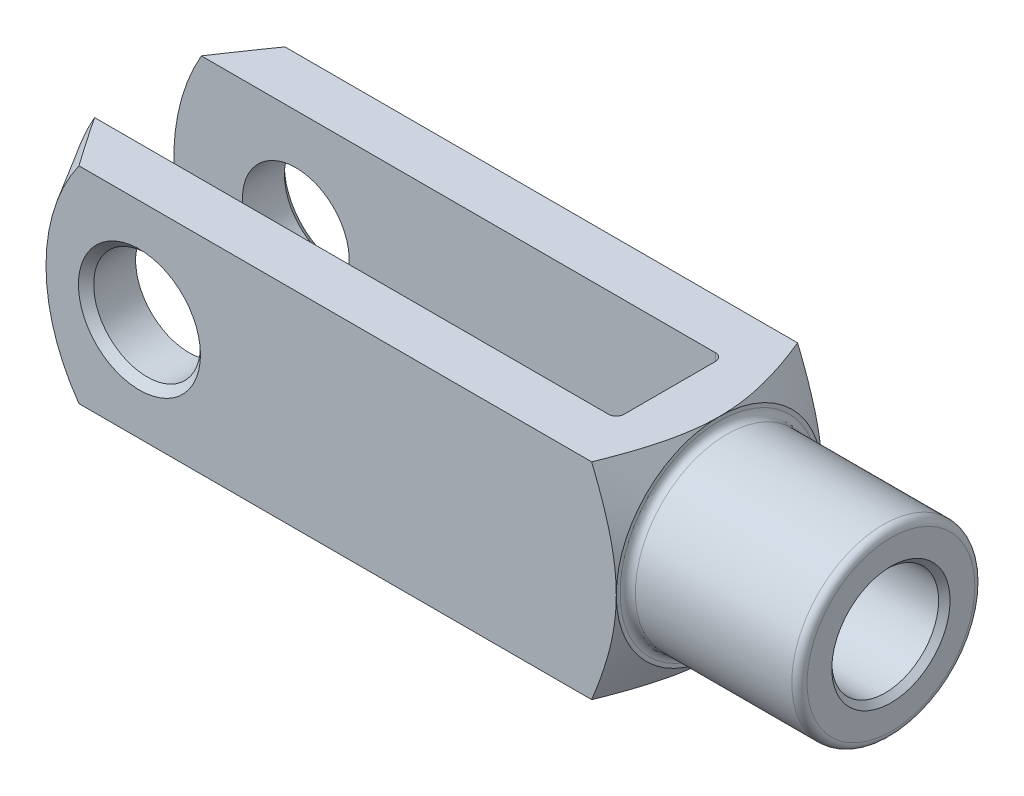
ISO-10303-21;
HEADER;
FILE_DESCRIPTION(('STEP AP214'),'2;1');
FILE_NAME('part.step','',(''),(''),'','','');
FILE_SCHEMA(('AUTOMOTIVE_DESIGN { 1 0 10303 214 1 1 1 1 }'));
ENDSEC;
DATA;
#1=APPLICATION_CONTEXT('core data for automotive mechanical design processes');
#2=APPLICATION_PROTOCOL_DEFINITION('international standard','automotive_design',2000,#1);
#3=PRODUCT_CONTEXT('',#1,'mechanical');
#4=PRODUCT('Part','Part','',(#3));
#5=PRODUCT_RELATED_PRODUCT_CATEGORY('part','',(#4));
#6=PRODUCT_DEFINITION_FORMATION('','',#4);
#7=PRODUCT_DEFINITION_CONTEXT('part definition',#1,'design');
#8=PRODUCT_DEFINITION('design','',#6,#7);
#9=PRODUCT_DEFINITION_SHAPE('','',#8);
#10=(LENGTH_UNIT() NAMED_UNIT(*) SI_UNIT(.MILLI.,.METRE.));
#11=(NAMED_UNIT(*) PLANE_ANGLE_UNIT() SI_UNIT($,.RADIAN.));
#12=(NAMED_UNIT(*) SI_UNIT($,.STERADIAN.) SOLID_ANGLE_UNIT());
#13=UNCERTAINTY_MEASURE_WITH_UNIT(LENGTH_MEASURE(1.E-05),#10,'distance_accuracy_value','');
#14=(GEOMETRIC_REPRESENTATION_CONTEXT(3) GLOBAL_UNCERTAINTY_ASSIGNED_CONTEXT((#13)) GLOBAL_UNIT_ASSIGNED_CONTEXT((#10,
#11,#12)) REPRESENTATION_CONTEXT('',''));
#15=CARTESIAN_POINT('',(0.,0.,0.));
#16=DIRECTION('',(0.,0.,1.));
#17=DIRECTION('',(1.,0.,0.));
#18=AXIS2_PLACEMENT_3D('',#15,#16,#17);
#19=CARTESIAN_POINT('',(-30.,-13.5,-5.99999999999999));
#20=DIRECTION('',(0.,-1.,0.));
#21=DIRECTION('',(0.,0.,-1.));
#22=AXIS2_PLACEMENT_3D('',#19,#20,#21);
#23=CYLINDRICAL_SURFACE('',#22,1.);
#24=DIRECTION('',(0.,1.,0.));
#25=VECTOR('',#24,1.);
#26=CARTESIAN_POINT('',(-29.,-13.5,-5.99999999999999));
#27=LINE('',#26,#25);
#28=CARTESIAN_POINT('',(-29.,-3.60555127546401,-5.99999999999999));
#29=VERTEX_POINT('',#28);
#30=CARTESIAN_POINT('',(-29.,-13.5,-5.99999999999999));
#31=VERTEX_POINT('',#30);
#32=EDGE_CURVE('E357',#29,#31,#27,.F.);
#33=ORIENTED_EDGE('',*,*,#32,.F.);
#34=CARTESIAN_POINT('',(-29.,-3.60555127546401,-5.99999999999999));
#35=CARTESIAN_POINT('',(-29.000007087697,-3.55494177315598,-6.03041382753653));
#36=CARTESIAN_POINT('',(-29.001386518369,-3.50396296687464,-6.06017529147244));
#37=CARTESIAN_POINT('',(-29.0065960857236,-3.4013852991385,-6.11833715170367));
#38=CARTESIAN_POINT('',(-29.0104251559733,-3.34978671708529,-6.14673813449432));
#39=CARTESIAN_POINT('',(-29.0251248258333,-3.19441978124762,-6.22972265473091));
#40=CARTESIAN_POINT('',(-29.0392107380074,-3.08983806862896,-6.28223313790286));
#41=CARTESIAN_POINT('',(-29.0740643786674,-2.87967288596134,-6.38129477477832));
#42=CARTESIAN_POINT('',(-29.0947990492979,-2.77409682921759,-6.42787385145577));
#43=CARTESIAN_POINT('',(-29.1416261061,-2.56173841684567,-6.51542025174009));
#44=CARTESIAN_POINT('',(-29.1677227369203,-2.45495516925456,-6.55638308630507));
#45=CARTESIAN_POINT('',(-29.2462471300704,-2.1566219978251,-6.66259073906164));
#46=CARTESIAN_POINT('',(-29.3033047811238,-1.9640983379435,-6.72176788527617));
#47=CARTESIAN_POINT('',(-29.4262418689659,-1.57742895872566,-6.82288362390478));
#48=CARTESIAN_POINT('',(-29.4921270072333,-1.38328226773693,-6.86481100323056));
#49=CARTESIAN_POINT('',(-29.6980114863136,-0.798929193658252,-6.96548017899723));
#50=CARTESIAN_POINT('',(-29.8462392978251,-0.406811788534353,-6.99910832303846));
#51=CARTESIAN_POINT('',(-29.9960560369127,-0.010434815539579,-6.99999416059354));
#52=CARTESIAN_POINT('',(-29.998028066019,-0.00521731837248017,-6.99999999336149));
#53=CARTESIAN_POINT('',(-30.,0.,-7.));
#54=B_SPLINE_CURVE_WITH_KNOTS('',3,(#34,#35,#36,#37,#38,#39,#40,#41,#42,#43,#44,#45,#46,#47,#48,
#49,#50,#51,#52,#53),.UNSPECIFIED.,.F.,.F.,(4,2,2,2,2,2,2,2,2,4),(0.,0.177083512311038,
0.354089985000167,0.707258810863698,1.05869820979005,1.4104168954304,2.037236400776,
2.66446272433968,3.91892182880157,3.93565503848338),.UNSPECIFIED.);
#55=CARTESIAN_POINT('',(-30.,0.,-7.));
#56=VERTEX_POINT('',#55);
#57=EDGE_CURVE('E390',#29,#56,#54,.T.);
#58=ORIENTED_EDGE('',*,*,#57,.T.);
#59=DIRECTION('',(0.,1.,0.));
#60=VECTOR('',#59,1.);
#61=CARTESIAN_POINT('',(-30.,13.5,-6.99999999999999));
#62=LINE('',#61,#60);
#63=CARTESIAN_POINT('',(-30.,-13.5,-6.99999999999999));
#64=VERTEX_POINT('',#63);
#65=EDGE_CURVE('E182',#64,#56,#62,.T.);
#66=ORIENTED_EDGE('',*,*,#65,.F.);
#67=CARTESIAN_POINT('',(-30.,-13.5,-5.99999999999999));
#68=DIRECTION('',(0.,-1.,0.));
#69=DIRECTION('',(0.,0.,-1.));
#70=AXIS2_PLACEMENT_3D('',#67,#68,#69);
#71=CIRCLE('',#70,1.);
#72=EDGE_CURVE('E197',#31,#64,#71,.F.);
#73=ORIENTED_EDGE('',*,*,#72,.F.);
#74=EDGE_LOOP('',(#33,#58,#66,#73));
#75=FACE_BOUND('',#74,.T.);
#76=ADVANCED_FACE('F37',(#75),#23,.F.);
#77=CARTESIAN_POINT('',(-29.,-13.5,-6.99999999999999));
#78=DIRECTION('',(1.,0.,0.));
#79=DIRECTION('',(0.,0.,-1.));
#80=AXIS2_PLACEMENT_3D('',#77,#78,#79);
#81=PLANE('',#80);
#82=CARTESIAN_POINT('',(-29.,13.5,-5.99999999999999));
#83=VERTEX_POINT('',#82);
#84=CARTESIAN_POINT('',(-29.,3.60555127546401,-5.99999999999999));
#85=VERTEX_POINT('',#84);
#86=EDGE_CURVE('E373',#83,#85,#27,.F.);
#87=ORIENTED_EDGE('',*,*,#86,.T.);
#88=CARTESIAN_POINT('',(-29.,0.,0.));
#89=DIRECTION('',(1.,0.,0.));
#90=DIRECTION('',(0.,0.,-1.));
#91=AXIS2_PLACEMENT_3D('',#88,#89,#90);
#92=CIRCLE('',#91,7.);
#93=CARTESIAN_POINT('',(-29.,3.60555127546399,6.));
#94=VERTEX_POINT('',#93);
#95=EDGE_CURVE('E447',#85,#94,#92,.T.);
#96=ORIENTED_EDGE('',*,*,#95,.T.);
#97=DIRECTION('',(0.,1.,0.));
#98=VECTOR('',#97,1.);
#99=CARTESIAN_POINT('',(-29.,13.5,6.));
#100=LINE('',#99,#98);
#101=CARTESIAN_POINT('',(-29.,13.5,6.));
#102=VERTEX_POINT('',#101);
#103=EDGE_CURVE('E160',#94,#102,#100,.T.);
#104=ORIENTED_EDGE('',*,*,#103,.T.);
#105=DIRECTION('',(0.,0.,-1.));
#106=VECTOR('',#105,1.);
#107=CARTESIAN_POINT('',(-29.,13.5,-6.99999999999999));
#108=LINE('',#107,#106);
#109=EDGE_CURVE('E337',#102,#83,#108,.T.);
#110=ORIENTED_EDGE('',*,*,#109,.T.);
#111=EDGE_LOOP('',(#87,#96,#104,#110));
#112=FACE_BOUND('',#111,.T.);
#113=ADVANCED_FACE('F492',(#112),#81,.F.);
#114=CARTESIAN_POINT('',(-30.,-13.5,6.));
#115=DIRECTION('',(0.,-1.,0.));
#116=DIRECTION('',(0.,0.,-1.));
#117=AXIS2_PLACEMENT_3D('',#114,#115,#116);
#118=CYLINDRICAL_SURFACE('',#117,1.);
#119=ORIENTED_EDGE('',*,*,#103,.F.);
#120=CARTESIAN_POINT('',(-29.,3.60555127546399,6.));
#121=CARTESIAN_POINT('',(-29.000007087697,3.55494177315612,6.03041382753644));
#122=CARTESIAN_POINT('',(-29.001386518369,3.50396296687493,6.06017529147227));
#123=CARTESIAN_POINT('',(-29.0065960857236,3.4013852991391,6.11833715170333));
#124=CARTESIAN_POINT('',(-29.0104251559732,3.34978671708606,6.1467381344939));
#125=CARTESIAN_POINT('',(-29.0251248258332,3.19441978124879,6.2297226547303));
#126=CARTESIAN_POINT('',(-29.0392107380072,3.08983806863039,6.28223313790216));
#127=CARTESIAN_POINT('',(-29.0740643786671,2.87967288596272,6.3812947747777));
#128=CARTESIAN_POINT('',(-29.0947990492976,2.77409682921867,6.42787385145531));
#129=CARTESIAN_POINT('',(-29.1416261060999,2.56173841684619,6.51542025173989));
#130=CARTESIAN_POINT('',(-29.1677227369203,2.45495516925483,6.55638308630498));
#131=CARTESIAN_POINT('',(-29.2462471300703,2.15662199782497,6.66259073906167));
#132=CARTESIAN_POINT('',(-29.3033047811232,1.96409833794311,6.72176788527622));
#133=CARTESIAN_POINT('',(-29.4262418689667,1.57742895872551,6.82288362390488));
#134=CARTESIAN_POINT('',(-29.4921270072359,1.38328226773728,6.86481100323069));
#135=CARTESIAN_POINT('',(-29.698011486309,0.798929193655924,6.96548017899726));
#136=CARTESIAN_POINT('',(-29.8462392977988,0.406811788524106,6.9991083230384));
#137=CARTESIAN_POINT('',(-29.996056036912,0.0104348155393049,6.99999416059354));
#138=CARTESIAN_POINT('',(-29.9980280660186,0.00521731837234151,6.99999999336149));
#139=CARTESIAN_POINT('',(-30.,0.,7.));
#140=B_SPLINE_CURVE_WITH_KNOTS('',3,(#120,#121,#122,#123,#124,#125,#126,#127,#128,#129,#130,
#131,#132,#133,#134,#135,#136,#137,#138,#139),.UNSPECIFIED.,.F.,.F.,(4,2,2,2,2,2,2,2,2,4),(0.,
0.177083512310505,0.354089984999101,0.70725881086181,1.05869820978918,1.4104168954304,
2.03723640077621,2.66446272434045,3.91892182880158,3.93565503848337),.UNSPECIFIED.);
#141=CARTESIAN_POINT('',(-30.,0.,7.));
#142=VERTEX_POINT('',#141);
#143=EDGE_CURVE('E145',#94,#142,#140,.T.);
#144=ORIENTED_EDGE('',*,*,#143,.T.);
#145=DIRECTION('',(0.,1.,0.));
#146=VECTOR('',#145,1.);
#147=CARTESIAN_POINT('',(-30.,-13.5,7.));
#148=LINE('',#147,#146);
#149=CARTESIAN_POINT('',(-30.,13.5,7.));
#150=VERTEX_POINT('',#149);
#151=EDGE_CURVE('E159',#150,#142,#148,.F.);
#152=ORIENTED_EDGE('',*,*,#151,.F.);
#153=CARTESIAN_POINT('',(-30.,13.5,6.));
#154=DIRECTION('',(0.,1.,0.));
#155=DIRECTION('',(0.,0.,1.));
#156=AXIS2_PLACEMENT_3D('',#153,#154,#155);
#157=CIRCLE('',#156,1.);
#158=EDGE_CURVE('E189',#102,#150,#157,.F.);
#159=ORIENTED_EDGE('',*,*,#158,.F.);
#160=EDGE_LOOP('',(#119,#144,#152,#159));
#161=FACE_BOUND('',#160,.T.);
#162=ADVANCED_FACE('F156',(#161),#118,.F.);
#163=CARTESIAN_POINT('',(-101.,-13.5,-6.99999999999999));
#164=DIRECTION('',(0.,0.,-1.));
#165=DIRECTION('',(-1.,0.,0.));
#166=AXIS2_PLACEMENT_3D('',#163,#164,#165);
#167=PLANE('',#166);
#168=CARTESIAN_POINT('',(-85.,0.,-6.99999999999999));
#169=DIRECTION('',(0.,0.,-1.));
#170=DIRECTION('',(-1.,0.,0.));
#171=AXIS2_PLACEMENT_3D('',#168,#169,#170);
#172=CIRCLE('',#171,7.);
#173=CARTESIAN_POINT('',(-92.,0.,-6.99999999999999));
#174=VERTEX_POINT('',#173);
#175=EDGE_CURVE('E367',#174,#174,#172,.F.);
#176=ORIENTED_EDGE('',*,*,#175,.F.);
#177=EDGE_LOOP('',(#176));
#178=FACE_BOUND('',#177,.T.);
#179=CARTESIAN_POINT('',(-74.,0.,-6.99999999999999));
#180=DIRECTION('',(0.,0.,1.));
#181=DIRECTION('',(1.,0.,0.));
#182=AXIS2_PLACEMENT_3D('',#179,#180,#181);
#183=CIRCLE('',#182,27.);
#184=CARTESIAN_POINT('',(-97.3826859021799,13.5,-6.99999999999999));
#185=VERTEX_POINT('',#184);
#186=CARTESIAN_POINT('',(-97.3826859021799,-13.5,-6.99999999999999));
#187=VERTEX_POINT('',#186);
#188=EDGE_CURVE('E275',#185,#187,#183,.T.);
#189=ORIENTED_EDGE('',*,*,#188,.T.);
#190=DIRECTION('',(-1.,0.,0.));
#191=VECTOR('',#190,1.);
#192=CARTESIAN_POINT('',(-101.,-13.5,-6.99999999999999));
#193=LINE('',#192,#191);
#194=EDGE_CURVE('E332',#64,#187,#193,.T.);
#195=ORIENTED_EDGE('',*,*,#194,.F.);
#196=ORIENTED_EDGE('',*,*,#65,.T.);
#197=CARTESIAN_POINT('',(-30.,13.5,-6.99999999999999));
#198=VERTEX_POINT('',#197);
#199=EDGE_CURVE('E179',#56,#198,#62,.T.);
#200=ORIENTED_EDGE('',*,*,#199,.T.);
#201=DIRECTION('',(-1.,0.,0.));
#202=VECTOR('',#201,1.);
#203=CARTESIAN_POINT('',(-101.,13.5,-6.99999999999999));
#204=LINE('',#203,#202);
#205=EDGE_CURVE('E345',#198,#185,#204,.T.);
#206=ORIENTED_EDGE('',*,*,#205,.T.);
#207=EDGE_LOOP('',(#189,#195,#196,#200,#206));
#208=FACE_BOUND('',#207,.T.);
#209=ADVANCED_FACE('F393',(#178,#208),#167,.F.);
#210=CARTESIAN_POINT('',(-101.,-13.5,7.00000000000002));
#211=DIRECTION('',(0.,0.,1.));
#212=DIRECTION('',(1.,0.,0.));
#213=AXIS2_PLACEMENT_3D('',#210,#211,#212);
#214=PLANE('',#213);
#215=CARTESIAN_POINT('',(-85.,0.,7.00000000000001));
#216=DIRECTION('',(0.,0.,1.));
#217=DIRECTION('',(1.,0.,0.));
#218=AXIS2_PLACEMENT_3D('',#215,#216,#217);
#219=CIRCLE('',#218,7.);
#220=CARTESIAN_POINT('',(-78.,0.,7.00000000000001));
#221=VERTEX_POINT('',#220);
#222=EDGE_CURVE('E344',#221,#221,#219,.F.);
#223=ORIENTED_EDGE('',*,*,#222,.F.);
#224=EDGE_LOOP('',(#223));
#225=FACE_BOUND('',#224,.T.);
#226=DIRECTION('',(1.,0.,0.));
#227=VECTOR('',#226,1.);
#228=CARTESIAN_POINT('',(-101.,-13.5,7.00000000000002));
#229=LINE('',#228,#227);
#230=CARTESIAN_POINT('',(-97.3826859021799,-13.5,7.00000000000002));
#231=VERTEX_POINT('',#230);
#232=CARTESIAN_POINT('',(-30.,-13.5,7.));
#233=VERTEX_POINT('',#232);
#234=EDGE_CURVE('E336',#231,#233,#229,.T.);
#235=ORIENTED_EDGE('',*,*,#234,.F.);
#236=CARTESIAN_POINT('',(-74.,0.,7.00000000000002));
#237=DIRECTION('',(0.,0.,1.));
#238=DIRECTION('',(1.,0.,0.));
#239=AXIS2_PLACEMENT_3D('',#236,#237,#238);
#240=CIRCLE('',#239,27.);
#241=CARTESIAN_POINT('',(-97.3826859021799,13.5,7.00000000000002));
#242=VERTEX_POINT('',#241);
#243=EDGE_CURVE('E450',#242,#231,#240,.T.);
#244=ORIENTED_EDGE('',*,*,#243,.F.);
#245=DIRECTION('',(1.,0.,0.));
#246=VECTOR('',#245,1.);
#247=CARTESIAN_POINT('',(-101.,13.5,7.00000000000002));
#248=LINE('',#247,#246);
#249=EDGE_CURVE('E176',#242,#150,#248,.T.);
#250=ORIENTED_EDGE('',*,*,#249,.T.);
#251=ORIENTED_EDGE('',*,*,#151,.T.);
#252=EDGE_CURVE('E164',#142,#233,#148,.F.);
#253=ORIENTED_EDGE('',*,*,#252,.T.);
#254=EDGE_LOOP('',(#235,#244,#250,#251,#253));
#255=FACE_BOUND('',#254,.T.);
#256=ADVANCED_FACE('F173',(#225,#255),#214,.F.);
#257=CARTESIAN_POINT('',(-101.,-13.5,13.5));
#258=DIRECTION('',(0.,0.,1.));
#259=DIRECTION('',(1.,0.,0.));
#260=AXIS2_PLACEMENT_3D('',#257,#258,#259);
#261=PLANE('',#260);
#262=CARTESIAN_POINT('',(-85.,0.,13.5));
#263=DIRECTION('',(0.,0.,1.));
#264=DIRECTION('',(1.,0.,0.));
#265=AXIS2_PLACEMENT_3D('',#262,#263,#264);
#266=CIRCLE('',#265,7.99999999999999);
#267=CARTESIAN_POINT('',(-77.,0.,13.5));
#268=VERTEX_POINT('',#267);
#269=EDGE_CURVE('E227',#268,#268,#266,.F.);
#270=ORIENTED_EDGE('',*,*,#269,.T.);
#271=EDGE_LOOP('',(#270));
#272=FACE_BOUND('',#271,.T.);
#273=DIRECTION('',(1.,0.,0.));
#274=VECTOR('',#273,1.);
#275=CARTESIAN_POINT('',(-101.,13.5,13.5));
#276=LINE('',#275,#274);
#277=CARTESIAN_POINT('',(-92.9257335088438,13.5,13.5));
#278=VERTEX_POINT('',#277);
#279=CARTESIAN_POINT('',(-25.7284752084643,13.5,13.5));
#280=VERTEX_POINT('',#279);
#281=EDGE_CURVE('E364',#278,#280,#276,.T.);
#282=ORIENTED_EDGE('',*,*,#281,.F.);
#283=CARTESIAN_POINT('',(-74.,0.,13.5));
#284=DIRECTION('',(0.,0.,1.));
#285=DIRECTION('',(1.,0.,0.));
#286=AXIS2_PLACEMENT_3D('',#283,#284,#285);
#287=CIRCLE('',#286,23.2472232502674);
#288=CARTESIAN_POINT('',(-92.9257335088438,-13.5,13.5));
#289=VERTEX_POINT('',#288);
#290=EDGE_CURVE('E61',#278,#289,#287,.T.);
#291=ORIENTED_EDGE('',*,*,#290,.T.);
#292=DIRECTION('',(1.,0.,0.));
#293=VECTOR('',#292,1.);
#294=CARTESIAN_POINT('',(-101.,-13.5,13.5));
#295=LINE('',#294,#293);
#296=CARTESIAN_POINT('',(-25.7284752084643,-13.5,13.5));
#297=VERTEX_POINT('',#296);
#298=EDGE_CURVE('E361',#289,#297,#295,.T.);
#299=ORIENTED_EDGE('',*,*,#298,.T.);
#300=CARTESIAN_POINT('',(-32.4304291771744,-27.5724587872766,13.5));
#301=CARTESIAN_POINT('',(-32.0854679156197,-26.9070980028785,13.5));
#302=CARTESIAN_POINT('',(-31.7423302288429,-26.240782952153,13.5));
#303=CARTESIAN_POINT('',(-31.0606693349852,-24.9057532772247,13.5));
#304=CARTESIAN_POINT('',(-30.722146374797,-24.2370385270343,13.5));
#305=CARTESIAN_POINT('',(-30.0501346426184,-22.8956223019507,13.5));
#306=CARTESIAN_POINT('',(-29.7166556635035,-22.2229159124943,13.5));
#307=CARTESIAN_POINT('',(-29.0567154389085,-20.8740781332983,13.5));
#308=CARTESIAN_POINT('',(-28.7302540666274,-20.197946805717,13.5));
#309=CARTESIAN_POINT('',(-28.0663268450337,-18.7997650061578,13.5));
#310=CARTESIAN_POINT('',(-27.7294196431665,-18.0774486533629,13.5));
#311=CARTESIAN_POINT('',(-27.0684159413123,-16.6268968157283,13.5));
#312=CARTESIAN_POINT('',(-26.7443201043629,-15.8986610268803,13.5));
#313=CARTESIAN_POINT('',(-26.2709527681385,-14.8009827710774,13.5));
#314=CARTESIAN_POINT('',(-26.1153242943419,-14.4342798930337,13.5));
#315=CARTESIAN_POINT('',(-25.808971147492,-13.6988341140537,13.5));
#316=CARTESIAN_POINT('',(-25.6582463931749,-13.3300912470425,13.5));
#317=CARTESIAN_POINT('',(-25.3624766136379,-12.5903643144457,13.5));
#318=CARTESIAN_POINT('',(-25.217431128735,-12.2193804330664,13.5));
#319=CARTESIAN_POINT('',(-24.9339241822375,-11.4749116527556,13.5));
#320=CARTESIAN_POINT('',(-24.7954625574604,-11.101426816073,13.5));
#321=CARTESIAN_POINT('',(-24.4969840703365,-10.2704027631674,13.5));
#322=CARTESIAN_POINT('',(-24.3388043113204,-9.81219978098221,13.5));
#323=CARTESIAN_POINT('',(-24.0360567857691,-8.89133812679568,13.5));
#324=CARTESIAN_POINT('',(-23.8914878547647,-8.42867983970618,13.5));
#325=CARTESIAN_POINT('',(-23.6186454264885,-7.49855908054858,13.5));
#326=CARTESIAN_POINT('',(-23.4903715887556,-7.03109670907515,13.5));
#327=CARTESIAN_POINT('',(-23.253182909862,-6.09124666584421,13.5));
#328=CARTESIAN_POINT('',(-23.1442678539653,-5.61885904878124,13.5));
#329=CARTESIAN_POINT('',(-22.9513715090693,-4.68052707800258,13.5));
#330=CARTESIAN_POINT('',(-22.8668649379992,-4.21469177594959,13.5));
#331=CARTESIAN_POINT('',(-22.7224231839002,-3.2791949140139,13.5));
#332=CARTESIAN_POINT('',(-22.662487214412,-2.80953347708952,13.5));
#333=CARTESIAN_POINT('',(-22.5696920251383,-1.86781820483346,13.5));
#334=CARTESIAN_POINT('',(-22.5368151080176,-1.3957661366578,13.5));
#335=CARTESIAN_POINT('',(-22.4995884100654,-0.450533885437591,13.5));
#336=CARTESIAN_POINT('',(-22.4952376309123,0.0226462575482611,13.5));
#337=CARTESIAN_POINT('',(-22.5145298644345,0.933916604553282,13.5));
#338=CARTESIAN_POINT('',(-22.5361561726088,1.37205133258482,13.5));
#339=CARTESIAN_POINT('',(-22.6032147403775,2.24647569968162,13.5));
#340=CARTESIAN_POINT('',(-22.6486469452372,2.68276534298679,13.5));
#341=CARTESIAN_POINT('',(-22.7616517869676,3.55266413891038,13.5));
#342=CARTESIAN_POINT('',(-22.8292358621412,3.98627178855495,13.5));
#343=CARTESIAN_POINT('',(-22.9843161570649,4.84988834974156,13.5));
#344=CARTESIAN_POINT('',(-23.0718129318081,5.27989716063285,13.5));
#345=CARTESIAN_POINT('',(-23.2670701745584,6.14834375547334,13.5));
#346=CARTESIAN_POINT('',(-23.3753438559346,6.58666526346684,13.5));
#347=CARTESIAN_POINT('',(-23.6077854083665,7.45904439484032,13.5));
#348=CARTESIAN_POINT('',(-23.7319534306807,7.89310197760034,13.5));
#349=CARTESIAN_POINT('',(-23.9937810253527,8.75708887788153,13.5));
#350=CARTESIAN_POINT('',(-24.1314399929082,9.18701837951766,13.5));
#351=CARTESIAN_POINT('',(-24.3464699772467,9.82901563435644,13.5));
#352=CARTESIAN_POINT('',(-24.4195690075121,10.0425285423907,13.5));
#353=CARTESIAN_POINT('',(-24.568387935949,10.4686386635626,13.5));
#354=CARTESIAN_POINT('',(-24.6441078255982,10.6812358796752,13.5));
#355=CARTESIAN_POINT('',(-24.8874050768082,11.3522977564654,13.5));
#356=CARTESIAN_POINT('',(-25.0593999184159,11.809164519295,13.5));
#357=CARTESIAN_POINT('',(-25.4127281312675,12.7192834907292,13.5));
#358=CARTESIAN_POINT('',(-25.5940620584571,13.1725354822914,13.5));
#359=CARTESIAN_POINT('',(-25.9645603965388,14.0759400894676,13.5));
#360=CARTESIAN_POINT('',(-26.1537265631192,14.5260919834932,13.5));
#361=CARTESIAN_POINT('',(-26.5385867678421,15.4235797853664,13.5));
#362=CARTESIAN_POINT('',(-26.7342806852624,15.8709157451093,13.5));
#363=CARTESIAN_POINT('',(-27.1313434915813,16.7635184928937,13.5));
#364=CARTESIAN_POINT('',(-27.3327171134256,17.2087831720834,13.5));
#365=CARTESIAN_POINT('',(-27.7401463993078,18.0971674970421,13.5));
#366=CARTESIAN_POINT('',(-27.9462021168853,18.540287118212,13.5));
#367=CARTESIAN_POINT('',(-28.5702761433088,19.8667324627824,13.5));
#368=CARTESIAN_POINT('',(-28.994251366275,20.7472561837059,13.5));
#369=CARTESIAN_POINT('',(-29.8552271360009,22.5052140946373,13.5));
#370=CARTESIAN_POINT('',(-30.2922634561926,23.3826306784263,13.5));
#371=CARTESIAN_POINT('',(-31.175287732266,25.1329651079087,13.5));
#372=CARTESIAN_POINT('',(-31.6212758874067,26.0058828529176,13.5));
#373=CARTESIAN_POINT('',(-32.5199360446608,27.7477195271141,13.5));
#374=CARTESIAN_POINT('',(-32.9726046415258,28.6166402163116,13.5));
#375=CARTESIAN_POINT('',(-33.8833677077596,30.3516218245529,13.5));
#376=CARTESIAN_POINT('',(-34.3414621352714,31.2176827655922,13.5));
#377=CARTESIAN_POINT('',(-35.1936403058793,32.8190461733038,13.5));
#378=CARTESIAN_POINT('',(-35.587127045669,33.5546666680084,13.5));
#379=CARTESIAN_POINT('',(-36.3767395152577,35.0244904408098,13.5));
#380=CARTESIAN_POINT('',(-36.7728652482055,35.7586937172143,13.5));
#381=CARTESIAN_POINT('',(-37.9646720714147,37.959711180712,13.5));
#382=CARTESIAN_POINT('',(-38.7636731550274,39.4247275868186,13.5));
#383=CARTESIAN_POINT('',(-40.3635150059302,42.3428467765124,13.5));
#384=CARTESIAN_POINT('',(-41.1643190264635,43.7959697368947,13.5));
#385=CARTESIAN_POINT('',(-42.3690675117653,45.973543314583,13.5));
#386=CARTESIAN_POINT('',(-42.7712089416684,46.6989923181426,13.5));
#387=CARTESIAN_POINT('',(-43.5765516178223,48.1493007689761,13.5));
#388=CARTESIAN_POINT('',(-43.9797528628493,48.8741602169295,13.5));
#389=CARTESIAN_POINT('',(-44.3834136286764,49.5987636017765,13.5));
#390=B_SPLINE_CURVE_WITH_KNOTS('',3,(#300,#301,#302,#303,#304,#305,#306,#307,#308,#309,#310,
#311,#312,#313,#314,#315,#316,#317,#318,#319,#320,#321,#322,#323,#324,#325,#326,#327,#328,#329,
#330,#331,#332,#333,#334,#335,#336,#337,#338,#339,#340,#341,#342,#343,#344,#345,#346,#347,#348,
#349,#350,#351,#352,#353,#354,#355,#356,#357,#358,#359,#360,#361,#362,#363,#364,#365,#366,#367,
#368,#369,#370,#371,#372,#373,#374,#375,#376,#377,#378,#379,#380,#381,#382,#383,#384,#385,#386,
#387,#388,#389),.UNSPECIFIED.,.F.,.F.,(4,2,2,2,2,2,2,2,2,2,2,2,2,2,2,2,2,2,2,2,2,2,2,2,2,2,2,2,
2,2,2,2,2,2,2,2,2,2,2,2,2,2,2,2,4),(0.,2.24841482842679,4.49694948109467,6.7493996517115,
9.00180908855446,11.3927930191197,13.7839005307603,14.9789541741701,16.1739880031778,
17.3689249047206,18.5638321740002,20.0178658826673,21.4717750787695,22.9256538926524,
24.379516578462,25.7992511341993,27.2189402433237,28.6377000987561,30.0564103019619,
31.3717442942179,32.6870752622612,34.0030864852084,35.3191343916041,36.6732741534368,
38.02742680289,39.3815187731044,40.0585434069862,40.7355658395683,42.1999363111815,
43.6643940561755,45.1291818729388,46.5939426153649,48.0599622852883,49.5259987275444,
52.4577049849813,55.3983502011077,58.3390609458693,61.2783212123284,64.2175588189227,
66.7202960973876,69.223036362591,74.2292153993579,79.2067218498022,81.6950831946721,
84.1834416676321),.UNSPECIFIED.);
#391=CARTESIAN_POINT('',(-22.5,0.,13.5));
#392=VERTEX_POINT('',#391);
#393=EDGE_CURVE('E304',#392,#297,#390,.F.);
#394=ORIENTED_EDGE('',*,*,#393,.F.);
#395=EDGE_CURVE('E302',#280,#392,#390,.F.);
#396=ORIENTED_EDGE('',*,*,#395,.F.);
#397=EDGE_LOOP('',(#282,#291,#299,#394,#396));
#398=FACE_BOUND('',#397,.T.);
#399=ADVANCED_FACE('F286',(#272,#398),#261,.T.);
#400=CARTESIAN_POINT('',(-101.,-13.5,13.5));
#401=DIRECTION('',(0.,-1.,0.));
#402=DIRECTION('',(0.,0.,-1.));
#403=AXIS2_PLACEMENT_3D('',#400,#401,#402);
#404=PLANE('',#403);
#405=ORIENTED_EDGE('',*,*,#194,.T.);
#406=CARTESIAN_POINT('',(-114.335378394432,-13.5,19.9067277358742));
#407=CARTESIAN_POINT('',(-113.589742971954,-13.5,18.6820817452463));
#408=CARTESIAN_POINT('',(-112.842635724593,-13.5,17.4583291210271));
#409=CARTESIAN_POINT('',(-111.344819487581,-13.5,15.0130165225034));
#410=CARTESIAN_POINT('',(-110.59411046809,-13.5,13.7914565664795));
#411=CARTESIAN_POINT('',(-109.08835575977,-13.5,11.350810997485));
#412=CARTESIAN_POINT('',(-108.33330956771,-13.5,10.1317256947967));
#413=CARTESIAN_POINT('',(-106.818093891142,-13.5,7.69674639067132));
#414=CARTESIAN_POINT('',(-106.057924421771,-13.5,6.48085237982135));
#415=CARTESIAN_POINT('',(-104.533017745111,-13.5,4.05566502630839));
#416=CARTESIAN_POINT('',(-103.768294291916,-13.5,2.84636304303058));
#417=CARTESIAN_POINT('',(-102.231147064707,-13.5,0.432665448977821));
#418=CARTESIAN_POINT('',(-101.458723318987,-13.5,-0.77173017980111));
#419=CARTESIAN_POINT('',(-99.9041541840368,-13.5,-3.17431337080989));
#420=CARTESIAN_POINT('',(-99.1220084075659,-13.5,-4.37250068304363));
#421=CARTESIAN_POINT('',(-97.9394271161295,-13.5,-6.1635918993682));
#422=CARTESIAN_POINT('',(-97.5436743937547,-13.5,-6.75958848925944));
#423=CARTESIAN_POINT('',(-96.7485806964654,-13.5,-7.94918226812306));
#424=CARTESIAN_POINT('',(-96.3492397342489,-13.5,-8.54277946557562));
#425=CARTESIAN_POINT('',(-95.5457822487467,-13.5,-9.72812510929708));
#426=CARTESIAN_POINT('',(-95.1416590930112,-13.5,-10.319869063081));
#427=CARTESIAN_POINT('',(-94.328600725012,-13.5,-11.500038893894));
#428=CARTESIAN_POINT('',(-93.9196655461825,-13.5,-12.0884647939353));
#429=CARTESIAN_POINT('',(-93.096256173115,-13.5,-13.2612199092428));
#430=CARTESIAN_POINT('',(-92.6817833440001,-13.5,-13.845550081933));
#431=CARTESIAN_POINT('',(-91.8461635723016,-13.5,-15.0094493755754));
#432=CARTESIAN_POINT('',(-91.4250164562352,-13.5,-15.5890183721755));
#433=CARTESIAN_POINT('',(-90.5742466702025,-13.5,-16.7429906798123));
#434=CARTESIAN_POINT('',(-90.1446143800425,-13.5,-17.3173869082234));
#435=CARTESIAN_POINT('',(-89.2757290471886,-13.5,-18.4588171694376));
#436=CARTESIAN_POINT('',(-88.8364767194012,-13.5,-19.0258517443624));
#437=CARTESIAN_POINT('',(-88.1685494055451,-13.5,-19.8695905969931));
#438=CARTESIAN_POINT('',(-87.9443098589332,-13.5,-20.1498090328));
#439=CARTESIAN_POINT('',(-87.4925201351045,-13.5,-20.7075596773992));
#440=CARTESIAN_POINT('',(-87.2649700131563,-13.5,-20.9850919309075));
#441=CARTESIAN_POINT('',(-86.8061154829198,-13.5,-21.5371561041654));
#442=CARTESIAN_POINT('',(-86.5748101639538,-13.5,-21.811687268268));
#443=CARTESIAN_POINT('',(-86.108015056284,-13.5,-22.3571941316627));
#444=CARTESIAN_POINT('',(-85.8725250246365,-13.5,-22.628169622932));
#445=CARTESIAN_POINT('',(-85.6347136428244,-13.5,-22.8971084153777));
#446=B_SPLINE_CURVE_WITH_KNOTS('',3,(#406,#407,#408,#409,#410,#411,#412,#413,#414,#415,#416,
#417,#418,#419,#420,#421,#422,#423,#424,#425,#426,#427,#428,#429,#430,#431,#432,#433,#434,#435,
#436,#437,#438,#439,#440,#441,#442,#443,#444,#445),.UNSPECIFIED.,.F.,.F.,(4,2,2,2,2,2,2,2,2,2,2,
2,2,2,2,2,2,2,2,4),(0.,4.30134760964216,8.60273091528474,12.904623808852,17.206503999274,
21.4989060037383,25.7912922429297,30.0838500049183,32.2301130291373,34.376368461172,
36.5260664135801,38.6757494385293,40.8249119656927,42.9741304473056,45.1259441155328,
47.2775984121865,48.3542633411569,49.4309103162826,50.5078224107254,51.5847972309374),.UNSPECIFIED.);
#447=CARTESIAN_POINT('',(-92.9257335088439,-13.5,-13.5));
#448=VERTEX_POINT('',#447);
#449=EDGE_CURVE('E274',#187,#448,#446,.T.);
#450=ORIENTED_EDGE('',*,*,#449,.T.);
#451=DIRECTION('',(1.,0.,0.));
#452=VECTOR('',#451,1.);
#453=CARTESIAN_POINT('',(-101.,-13.5,-13.5));
#454=LINE('',#453,#452);
#455=CARTESIAN_POINT('',(-25.7284752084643,-13.5,-13.5));
#456=VERTEX_POINT('',#455);
#457=EDGE_CURVE('E358',#448,#456,#454,.T.);
#458=ORIENTED_EDGE('',*,*,#457,.T.);
#459=CARTESIAN_POINT('',(-32.4304291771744,-13.5,-27.5724587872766));
#460=CARTESIAN_POINT('',(-32.0854679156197,-13.5,-26.9070980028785));
#461=CARTESIAN_POINT('',(-31.7423302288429,-13.5,-26.240782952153));
#462=CARTESIAN_POINT('',(-31.0606693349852,-13.5,-24.9057532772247));
#463=CARTESIAN_POINT('',(-30.722146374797,-13.5,-24.2370385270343));
#464=CARTESIAN_POINT('',(-30.0501346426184,-13.5,-22.8956223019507));
#465=CARTESIAN_POINT('',(-29.7166556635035,-13.5,-22.2229159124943));
#466=CARTESIAN_POINT('',(-29.0567154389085,-13.5,-20.8740781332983));
#467=CARTESIAN_POINT('',(-28.7302540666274,-13.5,-20.197946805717));
#468=CARTESIAN_POINT('',(-28.0663268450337,-13.5,-18.7997650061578));
#469=CARTESIAN_POINT('',(-27.7294196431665,-13.5,-18.0774486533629));
#470=CARTESIAN_POINT('',(-27.0684159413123,-13.5,-16.6268968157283));
#471=CARTESIAN_POINT('',(-26.7443201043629,-13.5,-15.8986610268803));
#472=CARTESIAN_POINT('',(-26.2709527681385,-13.5,-14.8009827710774));
#473=CARTESIAN_POINT('',(-26.1153242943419,-13.5,-14.4342798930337));
#474=CARTESIAN_POINT('',(-25.808971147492,-13.5,-13.6988341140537));
#475=CARTESIAN_POINT('',(-25.6582463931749,-13.5,-13.3300912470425));
#476=CARTESIAN_POINT('',(-25.3624766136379,-13.5,-12.5903643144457));
#477=CARTESIAN_POINT('',(-25.217431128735,-13.5,-12.2193804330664));
#478=CARTESIAN_POINT('',(-24.9339241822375,-13.5,-11.4749116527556));
#479=CARTESIAN_POINT('',(-24.7954625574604,-13.5,-11.101426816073));
#480=CARTESIAN_POINT('',(-24.4969840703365,-13.5,-10.2704027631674));
#481=CARTESIAN_POINT('',(-24.3388043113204,-13.5,-9.81219978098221));
#482=CARTESIAN_POINT('',(-24.0360567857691,-13.5,-8.89133812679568));
#483=CARTESIAN_POINT('',(-23.8914878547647,-13.5,-8.42867983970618));
#484=CARTESIAN_POINT('',(-23.6186454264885,-13.5,-7.49855908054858));
#485=CARTESIAN_POINT('',(-23.4903715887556,-13.5,-7.03109670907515));
#486=CARTESIAN_POINT('',(-23.253182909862,-13.5,-6.09124666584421));
#487=CARTESIAN_POINT('',(-23.1442678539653,-13.5,-5.61885904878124));
#488=CARTESIAN_POINT('',(-22.9513715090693,-13.5,-4.68052707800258));
#489=CARTESIAN_POINT('',(-22.8668649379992,-13.5,-4.21469177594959));
#490=CARTESIAN_POINT('',(-22.7224231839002,-13.5,-3.2791949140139));
#491=CARTESIAN_POINT('',(-22.662487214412,-13.5,-2.80953347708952));
#492=CARTESIAN_POINT('',(-22.5696920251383,-13.5,-1.86781820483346));
#493=CARTESIAN_POINT('',(-22.5368151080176,-13.5,-1.3957661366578));
#494=CARTESIAN_POINT('',(-22.4995884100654,-13.5,-0.450533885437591));
#495=CARTESIAN_POINT('',(-22.4952376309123,-13.5,0.0226462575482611));
#496=CARTESIAN_POINT('',(-22.5145298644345,-13.5,0.933916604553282));
#497=CARTESIAN_POINT('',(-22.5361561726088,-13.5,1.37205133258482));
#498=CARTESIAN_POINT('',(-22.6032147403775,-13.5,2.24647569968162));
#499=CARTESIAN_POINT('',(-22.6486469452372,-13.5,2.68276534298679));
#500=CARTESIAN_POINT('',(-22.7616517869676,-13.5,3.55266413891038));
#501=CARTESIAN_POINT('',(-22.8292358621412,-13.5,3.98627178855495));
#502=CARTESIAN_POINT('',(-22.9843161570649,-13.5,4.84988834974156));
#503=CARTESIAN_POINT('',(-23.0718129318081,-13.5,5.27989716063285));
#504=CARTESIAN_POINT('',(-23.2670701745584,-13.5,6.14834375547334));
#505=CARTESIAN_POINT('',(-23.3753438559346,-13.5,6.58666526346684));
#506=CARTESIAN_POINT('',(-23.6077854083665,-13.5,7.45904439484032));
#507=CARTESIAN_POINT('',(-23.7319534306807,-13.5,7.89310197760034));
#508=CARTESIAN_POINT('',(-23.9937810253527,-13.5,8.75708887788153));
#509=CARTESIAN_POINT('',(-24.1314399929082,-13.5,9.18701837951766));
#510=CARTESIAN_POINT('',(-24.3464699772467,-13.5,9.82901563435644));
#511=CARTESIAN_POINT('',(-24.4195690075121,-13.5,10.0425285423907));
#512=CARTESIAN_POINT('',(-24.568387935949,-13.5,10.4686386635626));
#513=CARTESIAN_POINT('',(-24.6441078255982,-13.5,10.6812358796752));
#514=CARTESIAN_POINT('',(-24.8874050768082,-13.5,11.3522977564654));
#515=CARTESIAN_POINT('',(-25.0593999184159,-13.5,11.809164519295));
#516=CARTESIAN_POINT('',(-25.4127281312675,-13.5,12.7192834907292));
#517=CARTESIAN_POINT('',(-25.5940620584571,-13.5,13.1725354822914));
#518=CARTESIAN_POINT('',(-25.9645603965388,-13.5,14.0759400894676));
#519=CARTESIAN_POINT('',(-26.1537265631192,-13.5,14.5260919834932));
#520=CARTESIAN_POINT('',(-26.5385867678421,-13.5,15.4235797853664));
#521=CARTESIAN_POINT('',(-26.7342806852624,-13.5,15.8709157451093));
#522=CARTESIAN_POINT('',(-27.1313434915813,-13.5,16.7635184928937));
#523=CARTESIAN_POINT('',(-27.3327171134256,-13.5,17.2087831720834));
#524=CARTESIAN_POINT('',(-27.7401463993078,-13.5,18.0971674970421));
#525=CARTESIAN_POINT('',(-27.9462021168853,-13.5,18.540287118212));
#526=CARTESIAN_POINT('',(-28.5702761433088,-13.5,19.8667324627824));
#527=CARTESIAN_POINT('',(-28.994251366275,-13.5,20.7472561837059));
#528=CARTESIAN_POINT('',(-29.8552271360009,-13.5,22.5052140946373));
#529=CARTESIAN_POINT('',(-30.2922634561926,-13.5,23.3826306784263));
#530=CARTESIAN_POINT('',(-31.175287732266,-13.5,25.1329651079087));
#531=CARTESIAN_POINT('',(-31.6212758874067,-13.5,26.0058828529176));
#532=CARTESIAN_POINT('',(-32.5199360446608,-13.5,27.7477195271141));
#533=CARTESIAN_POINT('',(-32.9726046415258,-13.5,28.6166402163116));
#534=CARTESIAN_POINT('',(-33.8833677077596,-13.5,30.3516218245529));
#535=CARTESIAN_POINT('',(-34.3414621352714,-13.5,31.2176827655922));
#536=CARTESIAN_POINT('',(-35.1936403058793,-13.5,32.8190461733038));
#537=CARTESIAN_POINT('',(-35.587127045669,-13.5,33.5546666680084));
#538=CARTESIAN_POINT('',(-36.3767395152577,-13.5,35.0244904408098));
#539=CARTESIAN_POINT('',(-36.7728652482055,-13.5,35.7586937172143));
#540=CARTESIAN_POINT('',(-37.9646720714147,-13.5,37.959711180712));
#541=CARTESIAN_POINT('',(-38.7636731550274,-13.5,39.4247275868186));
#542=CARTESIAN_POINT('',(-40.3635150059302,-13.5,42.3428467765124));
#543=CARTESIAN_POINT('',(-41.1643190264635,-13.5,43.7959697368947));
#544=CARTESIAN_POINT('',(-42.3690675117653,-13.5,45.973543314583));
#545=CARTESIAN_POINT('',(-42.7712089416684,-13.5,46.6989923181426));
#546=CARTESIAN_POINT('',(-43.5765516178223,-13.5,48.1493007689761));
#547=CARTESIAN_POINT('',(-43.9797528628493,-13.5,48.8741602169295));
#548=CARTESIAN_POINT('',(-44.3834136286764,-13.5,49.5987636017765));
#549=B_SPLINE_CURVE_WITH_KNOTS('',3,(#459,#460,#461,#462,#463,#464,#465,#466,#467,#468,#469,
#470,#471,#472,#473,#474,#475,#476,#477,#478,#479,#480,#481,#482,#483,#484,#485,#486,#487,#488,
#489,#490,#491,#492,#493,#494,#495,#496,#497,#498,#499,#500,#501,#502,#503,#504,#505,#506,#507,
#508,#509,#510,#511,#512,#513,#514,#515,#516,#517,#518,#519,#520,#521,#522,#523,#524,#525,#526,
#527,#528,#529,#530,#531,#532,#533,#534,#535,#536,#537,#538,#539,#540,#541,#542,#543,#544,#545,
#546,#547,#548),.UNSPECIFIED.,.F.,.F.,(4,2,2,2,2,2,2,2,2,2,2,2,2,2,2,2,2,2,2,2,2,2,2,2,2,2,2,2,
2,2,2,2,2,2,2,2,2,2,2,2,2,2,2,2,4),(0.,2.24841482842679,4.49694948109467,6.7493996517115,
9.00180908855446,11.3927930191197,13.7839005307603,14.9789541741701,16.1739880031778,
17.3689249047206,18.5638321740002,20.0178658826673,21.4717750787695,22.9256538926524,
24.379516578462,25.7992511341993,27.2189402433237,28.6377000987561,30.0564103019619,
31.3717442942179,32.6870752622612,34.0030864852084,35.3191343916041,36.6732741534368,
38.02742680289,39.3815187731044,40.0585434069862,40.7355658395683,42.1999363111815,
43.6643940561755,45.1291818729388,46.5939426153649,48.0599622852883,49.5259987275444,
52.4577049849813,55.3983502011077,58.3390609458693,61.2783212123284,64.2175588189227,
66.7202960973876,69.223036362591,74.2292153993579,79.2067218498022,81.6950831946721,
84.1834416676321),.UNSPECIFIED.);
#550=CARTESIAN_POINT('',(-22.5,-13.5,0.));
#551=VERTEX_POINT('',#550);
#552=EDGE_CURVE('E303',#551,#456,#549,.F.);
#553=ORIENTED_EDGE('',*,*,#552,.F.);
#554=EDGE_CURVE('E294',#297,#551,#549,.F.);
#555=ORIENTED_EDGE('',*,*,#554,.F.);
#556=ORIENTED_EDGE('',*,*,#298,.F.);
#557=CARTESIAN_POINT('',(-85.6347136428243,-13.5,22.8971084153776));
#558=CARTESIAN_POINT('',(-85.8725250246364,-13.5,22.6281696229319));
#559=CARTESIAN_POINT('',(-86.108015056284,-13.5,22.3571941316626));
#560=CARTESIAN_POINT('',(-86.5748101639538,-13.5,21.8116872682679));
#561=CARTESIAN_POINT('',(-86.8061154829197,-13.5,21.5371561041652));
#562=CARTESIAN_POINT('',(-87.2649700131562,-13.5,20.9850919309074));
#563=CARTESIAN_POINT('',(-87.4925201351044,-13.5,20.7075596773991));
#564=CARTESIAN_POINT('',(-87.9443098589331,-13.5,20.1498090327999));
#565=CARTESIAN_POINT('',(-88.168549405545,-13.5,19.869590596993));
#566=CARTESIAN_POINT('',(-88.8364767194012,-13.5,19.0258517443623));
#567=CARTESIAN_POINT('',(-89.2757290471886,-13.5,18.4588171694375));
#568=CARTESIAN_POINT('',(-90.1446143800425,-13.5,17.3173869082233));
#569=CARTESIAN_POINT('',(-90.5742466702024,-13.5,16.7429906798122));
#570=CARTESIAN_POINT('',(-91.4250164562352,-13.5,15.5890183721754));
#571=CARTESIAN_POINT('',(-91.8461635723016,-13.5,15.0094493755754));
#572=CARTESIAN_POINT('',(-92.6817833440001,-13.5,13.8455500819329));
#573=CARTESIAN_POINT('',(-93.096256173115,-13.5,13.2612199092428));
#574=CARTESIAN_POINT('',(-93.9196655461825,-13.5,12.0884647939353));
#575=CARTESIAN_POINT('',(-94.328600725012,-13.5,11.500038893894));
#576=CARTESIAN_POINT('',(-95.1416590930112,-13.5,10.319869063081));
#577=CARTESIAN_POINT('',(-95.5457822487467,-13.5,9.7281251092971));
#578=CARTESIAN_POINT('',(-96.3492397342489,-13.5,8.54277946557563));
#579=CARTESIAN_POINT('',(-96.7485806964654,-13.5,7.94918226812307));
#580=CARTESIAN_POINT('',(-97.5436743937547,-13.5,6.75958848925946));
#581=CARTESIAN_POINT('',(-97.9394271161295,-13.5,6.16359189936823));
#582=CARTESIAN_POINT('',(-99.1220084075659,-13.5,4.37250068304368));
#583=CARTESIAN_POINT('',(-99.9041541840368,-13.5,3.17431337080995));
#584=CARTESIAN_POINT('',(-101.458723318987,-13.5,0.77173017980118));
#585=CARTESIAN_POINT('',(-102.231147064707,-13.5,-0.432665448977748));
#586=CARTESIAN_POINT('',(-103.768294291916,-13.5,-2.8463630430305));
#587=CARTESIAN_POINT('',(-104.533017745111,-13.5,-4.05566502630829));
#588=CARTESIAN_POINT('',(-106.057924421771,-13.5,-6.48085237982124));
#589=CARTESIAN_POINT('',(-106.818093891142,-13.5,-7.6967463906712));
#590=CARTESIAN_POINT('',(-108.33330956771,-13.5,-10.1317256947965));
#591=CARTESIAN_POINT('',(-109.08835575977,-13.5,-11.3508109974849));
#592=CARTESIAN_POINT('',(-110.59411046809,-13.5,-13.7914565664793));
#593=CARTESIAN_POINT('',(-111.344819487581,-13.5,-15.0130165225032));
#594=CARTESIAN_POINT('',(-112.842635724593,-13.5,-17.4583291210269));
#595=CARTESIAN_POINT('',(-113.589742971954,-13.5,-18.6820817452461));
#596=CARTESIAN_POINT('',(-114.335378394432,-13.5,-19.906727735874));
#597=B_SPLINE_CURVE_WITH_KNOTS('',3,(#557,#558,#559,#560,#561,#562,#563,#564,#565,#566,#567,
#568,#569,#570,#571,#572,#573,#574,#575,#576,#577,#578,#579,#580,#581,#582,#583,#584,#585,#586,
#587,#588,#589,#590,#591,#592,#593,#594,#595,#596),.UNSPECIFIED.,.F.,.F.,(4,2,2,2,2,2,2,2,2,2,2,
2,2,2,2,2,2,2,2,4),(0.,1.076974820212,2.15388691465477,3.23053388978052,4.3071988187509,
6.45885311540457,8.61066678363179,10.7598852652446,12.9090477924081,15.0587308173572,
17.2084287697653,19.3546842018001,21.500947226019,25.7935049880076,30.0858912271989,
34.3782932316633,38.6801734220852,42.9820663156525,47.283449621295,51.5847972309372),.UNSPECIFIED.);
#598=EDGE_CURVE('E265',#289,#231,#597,.T.);
#599=ORIENTED_EDGE('',*,*,#598,.T.);
#600=ORIENTED_EDGE('',*,*,#234,.T.);
#601=CARTESIAN_POINT('',(-30.,-13.5,6.));
#602=DIRECTION('',(0.,-1.,0.));
#603=DIRECTION('',(0.,0.,-1.));
#604=AXIS2_PLACEMENT_3D('',#601,#602,#603);
#605=CIRCLE('',#604,1.);
#606=CARTESIAN_POINT('',(-29.,-13.5,6.));
#607=VERTEX_POINT('',#606);
#608=EDGE_CURVE('E166',#233,#607,#605,.F.);
#609=ORIENTED_EDGE('',*,*,#608,.T.);
#610=DIRECTION('',(0.,0.,-1.));
#611=VECTOR('',#610,1.);
#612=CARTESIAN_POINT('',(-29.,-13.5,-6.99999999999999));
#613=LINE('',#612,#611);
#614=EDGE_CURVE('E340',#607,#31,#613,.T.);
#615=ORIENTED_EDGE('',*,*,#614,.T.);
#616=ORIENTED_EDGE('',*,*,#72,.T.);
#617=EDGE_LOOP('',(#405,#450,#458,#553,#555,#556,#599,#600,#609,#615,#616));
#618=FACE_BOUND('',#617,.T.);
#619=ADVANCED_FACE('F281',(#618),#404,.T.);
#620=CARTESIAN_POINT('',(-101.,-13.5,-13.5));
#621=DIRECTION('',(0.,0.,-1.));
#622=DIRECTION('',(-1.,0.,0.));
#623=AXIS2_PLACEMENT_3D('',#620,#621,#622);
#624=PLANE('',#623);
#625=CARTESIAN_POINT('',(-85.,0.,-13.5));
#626=DIRECTION('',(0.,0.,-1.));
#627=DIRECTION('',(-1.,0.,0.));
#628=AXIS2_PLACEMENT_3D('',#625,#626,#627);
#629=CIRCLE('',#628,7.99999999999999);
#630=CARTESIAN_POINT('',(-93.,0.,-13.5));
#631=VERTEX_POINT('',#630);
#632=EDGE_CURVE('E215',#631,#631,#629,.F.);
#633=ORIENTED_EDGE('',*,*,#632,.T.);
#634=EDGE_LOOP('',(#633));
#635=FACE_BOUND('',#634,.T.);
#636=ORIENTED_EDGE('',*,*,#457,.F.);
#637=CARTESIAN_POINT('',(-74.,0.,-13.5));
#638=DIRECTION('',(0.,0.,1.));
#639=DIRECTION('',(1.,0.,0.));
#640=AXIS2_PLACEMENT_3D('',#637,#638,#639);
#641=CIRCLE('',#640,23.2472232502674);
#642=CARTESIAN_POINT('',(-92.9257335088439,13.5,-13.5));
#643=VERTEX_POINT('',#642);
#644=EDGE_CURVE('E406',#643,#448,#641,.T.);
#645=ORIENTED_EDGE('',*,*,#644,.F.);
#646=DIRECTION('',(1.,0.,0.));
#647=VECTOR('',#646,1.);
#648=CARTESIAN_POINT('',(-101.,13.5,-13.5));
#649=LINE('',#648,#647);
#650=CARTESIAN_POINT('',(-25.7284752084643,13.5,-13.5));
#651=VERTEX_POINT('',#650);
#652=EDGE_CURVE('E354',#643,#651,#649,.T.);
#653=ORIENTED_EDGE('',*,*,#652,.T.);
#654=CARTESIAN_POINT('',(-32.4304291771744,-27.5724587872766,-13.5));
#655=CARTESIAN_POINT('',(-32.0854679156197,-26.9070980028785,-13.5));
#656=CARTESIAN_POINT('',(-31.7423302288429,-26.240782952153,-13.5));
#657=CARTESIAN_POINT('',(-31.0606693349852,-24.9057532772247,-13.5));
#658=CARTESIAN_POINT('',(-30.722146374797,-24.2370385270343,-13.5));
#659=CARTESIAN_POINT('',(-30.0501346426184,-22.8956223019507,-13.5));
#660=CARTESIAN_POINT('',(-29.7166556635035,-22.2229159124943,-13.5));
#661=CARTESIAN_POINT('',(-29.0567154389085,-20.8740781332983,-13.5));
#662=CARTESIAN_POINT('',(-28.7302540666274,-20.197946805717,-13.5));
#663=CARTESIAN_POINT('',(-28.0663268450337,-18.7997650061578,-13.5));
#664=CARTESIAN_POINT('',(-27.7294196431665,-18.0774486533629,-13.5));
#665=CARTESIAN_POINT('',(-27.0684159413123,-16.6268968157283,-13.5));
#666=CARTESIAN_POINT('',(-26.7443201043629,-15.8986610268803,-13.5));
#667=CARTESIAN_POINT('',(-26.2709527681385,-14.8009827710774,-13.5));
#668=CARTESIAN_POINT('',(-26.1153242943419,-14.4342798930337,-13.5));
#669=CARTESIAN_POINT('',(-25.808971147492,-13.6988341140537,-13.5));
#670=CARTESIAN_POINT('',(-25.6582463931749,-13.3300912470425,-13.5));
#671=CARTESIAN_POINT('',(-25.3624766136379,-12.5903643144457,-13.5));
#672=CARTESIAN_POINT('',(-25.217431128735,-12.2193804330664,-13.5));
#673=CARTESIAN_POINT('',(-24.9339241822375,-11.4749116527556,-13.5));
#674=CARTESIAN_POINT('',(-24.7954625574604,-11.101426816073,-13.5));
#675=CARTESIAN_POINT('',(-24.4969840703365,-10.2704027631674,-13.5));
#676=CARTESIAN_POINT('',(-24.3388043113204,-9.81219978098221,-13.5));
#677=CARTESIAN_POINT('',(-24.0360567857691,-8.89133812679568,-13.5));
#678=CARTESIAN_POINT('',(-23.8914878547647,-8.42867983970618,-13.5));
#679=CARTESIAN_POINT('',(-23.6186454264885,-7.49855908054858,-13.5));
#680=CARTESIAN_POINT('',(-23.4903715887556,-7.03109670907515,-13.5));
#681=CARTESIAN_POINT('',(-23.253182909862,-6.09124666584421,-13.5));
#682=CARTESIAN_POINT('',(-23.1442678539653,-5.61885904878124,-13.5));
#683=CARTESIAN_POINT('',(-22.9513715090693,-4.68052707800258,-13.5));
#684=CARTESIAN_POINT('',(-22.8668649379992,-4.21469177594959,-13.5));
#685=CARTESIAN_POINT('',(-22.7224231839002,-3.2791949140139,-13.5));
#686=CARTESIAN_POINT('',(-22.662487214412,-2.80953347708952,-13.5));
#687=CARTESIAN_POINT('',(-22.5696920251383,-1.86781820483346,-13.5));
#688=CARTESIAN_POINT('',(-22.5368151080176,-1.3957661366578,-13.5));
#689=CARTESIAN_POINT('',(-22.4995884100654,-0.450533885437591,-13.5));
#690=CARTESIAN_POINT('',(-22.4952376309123,0.0226462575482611,-13.5));
#691=CARTESIAN_POINT('',(-22.5145298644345,0.933916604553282,-13.5));
#692=CARTESIAN_POINT('',(-22.5361561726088,1.37205133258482,-13.5));
#693=CARTESIAN_POINT('',(-22.6032147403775,2.24647569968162,-13.5));
#694=CARTESIAN_POINT('',(-22.6486469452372,2.68276534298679,-13.5));
#695=CARTESIAN_POINT('',(-22.7616517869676,3.55266413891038,-13.5));
#696=CARTESIAN_POINT('',(-22.8292358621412,3.98627178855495,-13.5));
#697=CARTESIAN_POINT('',(-22.9843161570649,4.84988834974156,-13.5));
#698=CARTESIAN_POINT('',(-23.0718129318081,5.27989716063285,-13.5));
#699=CARTESIAN_POINT('',(-23.2670701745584,6.14834375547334,-13.5));
#700=CARTESIAN_POINT('',(-23.3753438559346,6.58666526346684,-13.5));
#701=CARTESIAN_POINT('',(-23.6077854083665,7.45904439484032,-13.5));
#702=CARTESIAN_POINT('',(-23.7319534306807,7.89310197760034,-13.5));
#703=CARTESIAN_POINT('',(-23.9937810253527,8.75708887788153,-13.5));
#704=CARTESIAN_POINT('',(-24.1314399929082,9.18701837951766,-13.5));
#705=CARTESIAN_POINT('',(-24.3464699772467,9.82901563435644,-13.5));
#706=CARTESIAN_POINT('',(-24.4195690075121,10.0425285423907,-13.5));
#707=CARTESIAN_POINT('',(-24.568387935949,10.4686386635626,-13.5));
#708=CARTESIAN_POINT('',(-24.6441078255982,10.6812358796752,-13.5));
#709=CARTESIAN_POINT('',(-24.8874050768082,11.3522977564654,-13.5));
#710=CARTESIAN_POINT('',(-25.0593999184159,11.809164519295,-13.5));
#711=CARTESIAN_POINT('',(-25.4127281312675,12.7192834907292,-13.5));
#712=CARTESIAN_POINT('',(-25.5940620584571,13.1725354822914,-13.5));
#713=CARTESIAN_POINT('',(-25.9645603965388,14.0759400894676,-13.5));
#714=CARTESIAN_POINT('',(-26.1537265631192,14.5260919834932,-13.5));
#715=CARTESIAN_POINT('',(-26.5385867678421,15.4235797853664,-13.5));
#716=CARTESIAN_POINT('',(-26.7342806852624,15.8709157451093,-13.5));
#717=CARTESIAN_POINT('',(-27.1313434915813,16.7635184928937,-13.5));
#718=CARTESIAN_POINT('',(-27.3327171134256,17.2087831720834,-13.5));
#719=CARTESIAN_POINT('',(-27.7401463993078,18.0971674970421,-13.5));
#720=CARTESIAN_POINT('',(-27.9462021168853,18.540287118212,-13.5));
#721=CARTESIAN_POINT('',(-28.5702761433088,19.8667324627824,-13.5));
#722=CARTESIAN_POINT('',(-28.994251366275,20.7472561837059,-13.5));
#723=CARTESIAN_POINT('',(-29.8552271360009,22.5052140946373,-13.5));
#724=CARTESIAN_POINT('',(-30.2922634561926,23.3826306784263,-13.5));
#725=CARTESIAN_POINT('',(-31.175287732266,25.1329651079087,-13.5));
#726=CARTESIAN_POINT('',(-31.6212758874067,26.0058828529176,-13.5));
#727=CARTESIAN_POINT('',(-32.5199360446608,27.7477195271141,-13.5));
#728=CARTESIAN_POINT('',(-32.9726046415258,28.6166402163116,-13.5));
#729=CARTESIAN_POINT('',(-33.8833677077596,30.3516218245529,-13.5));
#730=CARTESIAN_POINT('',(-34.3414621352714,31.2176827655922,-13.5));
#731=CARTESIAN_POINT('',(-35.1936403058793,32.8190461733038,-13.5));
#732=CARTESIAN_POINT('',(-35.587127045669,33.5546666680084,-13.5));
#733=CARTESIAN_POINT('',(-36.3767395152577,35.0244904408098,-13.5));
#734=CARTESIAN_POINT('',(-36.7728652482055,35.7586937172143,-13.5));
#735=CARTESIAN_POINT('',(-37.9646720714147,37.959711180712,-13.5));
#736=CARTESIAN_POINT('',(-38.7636731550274,39.4247275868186,-13.5));
#737=CARTESIAN_POINT('',(-40.3635150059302,42.3428467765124,-13.5));
#738=CARTESIAN_POINT('',(-41.1643190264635,43.7959697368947,-13.5));
#739=CARTESIAN_POINT('',(-42.3690675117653,45.973543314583,-13.5));
#740=CARTESIAN_POINT('',(-42.7712089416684,46.6989923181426,-13.5));
#741=CARTESIAN_POINT('',(-43.5765516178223,48.1493007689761,-13.5));
#742=CARTESIAN_POINT('',(-43.9797528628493,48.8741602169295,-13.5));
#743=CARTESIAN_POINT('',(-44.3834136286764,49.5987636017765,-13.5));
#744=B_SPLINE_CURVE_WITH_KNOTS('',3,(#654,#655,#656,#657,#658,#659,#660,#661,#662,#663,#664,
#665,#666,#667,#668,#669,#670,#671,#672,#673,#674,#675,#676,#677,#678,#679,#680,#681,#682,#683,
#684,#685,#686,#687,#688,#689,#690,#691,#692,#693,#694,#695,#696,#697,#698,#699,#700,#701,#702,
#703,#704,#705,#706,#707,#708,#709,#710,#711,#712,#713,#714,#715,#716,#717,#718,#719,#720,#721,
#722,#723,#724,#725,#726,#727,#728,#729,#730,#731,#732,#733,#734,#735,#736,#737,#738,#739,#740,
#741,#742,#743),.UNSPECIFIED.,.F.,.F.,(4,2,2,2,2,2,2,2,2,2,2,2,2,2,2,2,2,2,2,2,2,2,2,2,2,2,2,2,
2,2,2,2,2,2,2,2,2,2,2,2,2,2,2,2,4),(0.,2.24841482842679,4.49694948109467,6.7493996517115,
9.00180908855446,11.3927930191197,13.7839005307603,14.9789541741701,16.1739880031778,
17.3689249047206,18.5638321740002,20.0178658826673,21.4717750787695,22.9256538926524,
24.379516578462,25.7992511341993,27.2189402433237,28.6377000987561,30.0564103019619,
31.3717442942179,32.6870752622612,34.0030864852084,35.3191343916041,36.6732741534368,
38.02742680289,39.3815187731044,40.0585434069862,40.7355658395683,42.1999363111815,
43.6643940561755,45.1291818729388,46.5939426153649,48.0599622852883,49.5259987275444,
52.4577049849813,55.3983502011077,58.3390609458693,61.2783212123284,64.2175588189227,
66.7202960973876,69.223036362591,74.2292153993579,79.2067218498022,81.6950831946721,
84.1834416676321),.UNSPECIFIED.);
#745=CARTESIAN_POINT('',(-22.5,0.,-13.5));
#746=VERTEX_POINT('',#745);
#747=EDGE_CURVE('E324',#746,#651,#744,.T.);
#748=ORIENTED_EDGE('',*,*,#747,.F.);
#749=EDGE_CURVE('E331',#456,#746,#744,.T.);
#750=ORIENTED_EDGE('',*,*,#749,.F.);
#751=EDGE_LOOP('',(#636,#645,#653,#748,#750));
#752=FACE_BOUND('',#751,.T.);
#753=ADVANCED_FACE('F285',(#635,#752),#624,.T.);
#754=CARTESIAN_POINT('',(-101.,13.5,13.5));
#755=DIRECTION('',(0.,1.,0.));
#756=DIRECTION('',(0.,0.,1.));
#757=AXIS2_PLACEMENT_3D('',#754,#755,#756);
#758=PLANE('',#757);
#759=ORIENTED_EDGE('',*,*,#652,.F.);
#760=CARTESIAN_POINT('',(-85.6347136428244,13.5,-22.8971084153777));
#761=CARTESIAN_POINT('',(-85.8725250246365,13.5,-22.628169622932));
#762=CARTESIAN_POINT('',(-86.108015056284,13.5,-22.3571941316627));
#763=CARTESIAN_POINT('',(-86.5748101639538,13.5,-21.811687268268));
#764=CARTESIAN_POINT('',(-86.8061154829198,13.5,-21.5371561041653));
#765=CARTESIAN_POINT('',(-87.2649700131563,13.5,-20.9850919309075));
#766=CARTESIAN_POINT('',(-87.4925201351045,13.5,-20.7075596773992));
#767=CARTESIAN_POINT('',(-87.9443098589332,13.5,-20.1498090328));
#768=CARTESIAN_POINT('',(-88.1685494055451,13.5,-19.8695905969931));
#769=CARTESIAN_POINT('',(-88.8364767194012,13.5,-19.0258517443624));
#770=CARTESIAN_POINT('',(-89.2757290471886,13.5,-18.4588171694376));
#771=CARTESIAN_POINT('',(-90.1446143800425,13.5,-17.3173869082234));
#772=CARTESIAN_POINT('',(-90.5742466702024,13.5,-16.7429906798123));
#773=CARTESIAN_POINT('',(-91.4250164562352,13.5,-15.5890183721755));
#774=CARTESIAN_POINT('',(-91.8461635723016,13.5,-15.0094493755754));
#775=CARTESIAN_POINT('',(-92.6817833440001,13.5,-13.845550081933));
#776=CARTESIAN_POINT('',(-93.096256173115,13.5,-13.2612199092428));
#777=CARTESIAN_POINT('',(-93.9196655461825,13.5,-12.0884647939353));
#778=CARTESIAN_POINT('',(-94.328600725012,13.5,-11.500038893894));
#779=CARTESIAN_POINT('',(-95.1416590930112,13.5,-10.319869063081));
#780=CARTESIAN_POINT('',(-95.5457822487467,13.5,-9.72812510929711));
#781=CARTESIAN_POINT('',(-96.3492397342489,13.5,-8.54277946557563));
#782=CARTESIAN_POINT('',(-96.7485806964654,13.5,-7.94918226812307));
#783=CARTESIAN_POINT('',(-97.5436743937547,13.5,-6.75958848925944));
#784=CARTESIAN_POINT('',(-97.9394271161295,13.5,-6.16359189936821));
#785=CARTESIAN_POINT('',(-99.1220084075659,13.5,-4.37250068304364));
#786=CARTESIAN_POINT('',(-99.9041541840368,13.5,-3.1743133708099));
#787=CARTESIAN_POINT('',(-101.458723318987,13.5,-0.771730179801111));
#788=CARTESIAN_POINT('',(-102.231147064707,13.5,0.43266544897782));
#789=CARTESIAN_POINT('',(-103.768294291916,13.5,2.84636304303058));
#790=CARTESIAN_POINT('',(-104.533017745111,13.5,4.05566502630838));
#791=CARTESIAN_POINT('',(-106.057924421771,13.5,6.48085237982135));
#792=CARTESIAN_POINT('',(-106.818093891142,13.5,7.69674639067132));
#793=CARTESIAN_POINT('',(-108.33330956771,13.5,10.1317256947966));
#794=CARTESIAN_POINT('',(-109.08835575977,13.5,11.350810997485));
#795=CARTESIAN_POINT('',(-110.59411046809,13.5,13.7914565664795));
#796=CARTESIAN_POINT('',(-111.344819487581,13.5,15.0130165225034));
#797=CARTESIAN_POINT('',(-112.842635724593,13.5,17.4583291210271));
#798=CARTESIAN_POINT('',(-113.589742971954,13.5,18.6820817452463));
#799=CARTESIAN_POINT('',(-114.335378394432,13.5,19.9067277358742));
#800=B_SPLINE_CURVE_WITH_KNOTS('',3,(#760,#761,#762,#763,#764,#765,#766,#767,#768,#769,#770,
#771,#772,#773,#774,#775,#776,#777,#778,#779,#780,#781,#782,#783,#784,#785,#786,#787,#788,#789,
#790,#791,#792,#793,#794,#795,#796,#797,#798,#799),.UNSPECIFIED.,.F.,.F.,(4,2,2,2,2,2,2,2,2,2,2,
2,2,2,2,2,2,2,2,4),(0.,1.076974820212,2.15388691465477,3.23053388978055,4.30719881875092,
6.45885311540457,8.61066678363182,10.7598852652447,12.9090477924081,15.0587308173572,
17.2084287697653,19.3546842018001,21.5009472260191,25.7935049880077,30.0858912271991,
34.3782932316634,38.6801734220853,42.9820663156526,47.2834496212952,51.5847972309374),.UNSPECIFIED.);
#801=EDGE_CURVE('E245',#643,#185,#800,.T.);
#802=ORIENTED_EDGE('',*,*,#801,.T.);
#803=ORIENTED_EDGE('',*,*,#205,.F.);
#804=CARTESIAN_POINT('',(-30.,13.5,-5.99999999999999));
#805=DIRECTION('',(0.,1.,0.));
#806=DIRECTION('',(0.,0.,1.));
#807=AXIS2_PLACEMENT_3D('',#804,#805,#806);
#808=CIRCLE('',#807,1.);
#809=EDGE_CURVE('E194',#198,#83,#808,.F.);
#810=ORIENTED_EDGE('',*,*,#809,.T.);
#811=ORIENTED_EDGE('',*,*,#109,.F.);
#812=ORIENTED_EDGE('',*,*,#158,.T.);
#813=ORIENTED_EDGE('',*,*,#249,.F.);
#814=CARTESIAN_POINT('',(-114.335378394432,13.5,-19.906727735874));
#815=CARTESIAN_POINT('',(-113.589742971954,13.5,-18.6820817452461));
#816=CARTESIAN_POINT('',(-112.842635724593,13.5,-17.4583291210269));
#817=CARTESIAN_POINT('',(-111.344819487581,13.5,-15.0130165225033));
#818=CARTESIAN_POINT('',(-110.59411046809,13.5,-13.7914565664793));
#819=CARTESIAN_POINT('',(-109.08835575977,13.5,-11.3508109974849));
#820=CARTESIAN_POINT('',(-108.33330956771,13.5,-10.1317256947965));
#821=CARTESIAN_POINT('',(-106.818093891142,13.5,-7.6967463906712));
#822=CARTESIAN_POINT('',(-106.057924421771,13.5,-6.48085237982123));
#823=CARTESIAN_POINT('',(-104.533017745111,13.5,-4.05566502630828));
#824=CARTESIAN_POINT('',(-103.768294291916,13.5,-2.8463630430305));
#825=CARTESIAN_POINT('',(-102.231147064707,13.5,-0.432665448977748));
#826=CARTESIAN_POINT('',(-101.458723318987,13.5,0.771730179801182));
#827=CARTESIAN_POINT('',(-99.9041541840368,13.5,3.17431337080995));
#828=CARTESIAN_POINT('',(-99.1220084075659,13.5,4.37250068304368));
#829=CARTESIAN_POINT('',(-97.9394271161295,13.5,6.16359189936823));
#830=CARTESIAN_POINT('',(-97.5436743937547,13.5,6.75958848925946));
#831=CARTESIAN_POINT('',(-96.7485806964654,13.5,7.94918226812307));
#832=CARTESIAN_POINT('',(-96.3492397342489,13.5,8.54277946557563));
#833=CARTESIAN_POINT('',(-95.5457822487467,13.5,9.72812510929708));
#834=CARTESIAN_POINT('',(-95.1416590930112,13.5,10.319869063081));
#835=CARTESIAN_POINT('',(-94.328600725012,13.5,11.500038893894));
#836=CARTESIAN_POINT('',(-93.9196655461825,13.5,12.0884647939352));
#837=CARTESIAN_POINT('',(-93.096256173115,13.5,13.2612199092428));
#838=CARTESIAN_POINT('',(-92.6817833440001,13.5,13.8455500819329));
#839=CARTESIAN_POINT('',(-91.8461635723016,13.5,15.0094493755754));
#840=CARTESIAN_POINT('',(-91.4250164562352,13.5,15.5890183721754));
#841=CARTESIAN_POINT('',(-90.5742466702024,13.5,16.7429906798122));
#842=CARTESIAN_POINT('',(-90.1446143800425,13.5,17.3173869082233));
#843=CARTESIAN_POINT('',(-89.2757290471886,13.5,18.4588171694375));
#844=CARTESIAN_POINT('',(-88.8364767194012,13.5,19.0258517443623));
#845=CARTESIAN_POINT('',(-88.1685494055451,13.5,19.869590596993));
#846=CARTESIAN_POINT('',(-87.9443098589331,13.5,20.1498090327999));
#847=CARTESIAN_POINT('',(-87.4925201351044,13.5,20.7075596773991));
#848=CARTESIAN_POINT('',(-87.2649700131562,13.5,20.9850919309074));
#849=CARTESIAN_POINT('',(-86.8061154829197,13.5,21.5371561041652));
#850=CARTESIAN_POINT('',(-86.5748101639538,13.5,21.8116872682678));
#851=CARTESIAN_POINT('',(-86.108015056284,13.5,22.3571941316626));
#852=CARTESIAN_POINT('',(-85.8725250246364,13.5,22.6281696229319));
#853=CARTESIAN_POINT('',(-85.6347136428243,13.5,22.8971084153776));
#854=B_SPLINE_CURVE_WITH_KNOTS('',3,(#814,#815,#816,#817,#818,#819,#820,#821,#822,#823,#824,
#825,#826,#827,#828,#829,#830,#831,#832,#833,#834,#835,#836,#837,#838,#839,#840,#841,#842,#843,
#844,#845,#846,#847,#848,#849,#850,#851,#852,#853),.UNSPECIFIED.,.F.,.F.,(4,2,2,2,2,2,2,2,2,2,2,
2,2,2,2,2,2,2,2,4),(0.,4.30134760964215,8.6027309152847,12.904623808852,17.2065039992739,
21.4989060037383,25.7912922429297,30.0838500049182,32.2301130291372,34.3763684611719,
36.52606641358,38.6757494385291,40.8249119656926,42.9741304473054,45.1259441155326,
47.2775984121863,48.3542633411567,49.4309103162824,50.5078224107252,51.5847972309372),.UNSPECIFIED.);
#855=EDGE_CURVE('E237',#242,#278,#854,.T.);
#856=ORIENTED_EDGE('',*,*,#855,.T.);
#857=ORIENTED_EDGE('',*,*,#281,.T.);
#858=CARTESIAN_POINT('',(-32.4304291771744,13.5,-27.5724587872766));
#859=CARTESIAN_POINT('',(-32.0854679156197,13.5,-26.9070980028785));
#860=CARTESIAN_POINT('',(-31.7423302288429,13.5,-26.240782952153));
#861=CARTESIAN_POINT('',(-31.0606693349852,13.5,-24.9057532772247));
#862=CARTESIAN_POINT('',(-30.722146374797,13.5,-24.2370385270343));
#863=CARTESIAN_POINT('',(-30.0501346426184,13.5,-22.8956223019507));
#864=CARTESIAN_POINT('',(-29.7166556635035,13.5,-22.2229159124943));
#865=CARTESIAN_POINT('',(-29.0567154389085,13.5,-20.8740781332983));
#866=CARTESIAN_POINT('',(-28.7302540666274,13.5,-20.197946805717));
#867=CARTESIAN_POINT('',(-28.0663268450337,13.5,-18.7997650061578));
#868=CARTESIAN_POINT('',(-27.7294196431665,13.5,-18.0774486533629));
#869=CARTESIAN_POINT('',(-27.0684159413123,13.5,-16.6268968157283));
#870=CARTESIAN_POINT('',(-26.7443201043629,13.5,-15.8986610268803));
#871=CARTESIAN_POINT('',(-26.2709527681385,13.5,-14.8009827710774));
#872=CARTESIAN_POINT('',(-26.1153242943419,13.5,-14.4342798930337));
#873=CARTESIAN_POINT('',(-25.808971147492,13.5,-13.6988341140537));
#874=CARTESIAN_POINT('',(-25.6582463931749,13.5,-13.3300912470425));
#875=CARTESIAN_POINT('',(-25.3624766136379,13.5,-12.5903643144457));
#876=CARTESIAN_POINT('',(-25.217431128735,13.5,-12.2193804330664));
#877=CARTESIAN_POINT('',(-24.9339241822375,13.5,-11.4749116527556));
#878=CARTESIAN_POINT('',(-24.7954625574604,13.5,-11.101426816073));
#879=CARTESIAN_POINT('',(-24.4969840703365,13.5,-10.2704027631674));
#880=CARTESIAN_POINT('',(-24.3388043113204,13.5,-9.81219978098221));
#881=CARTESIAN_POINT('',(-24.0360567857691,13.5,-8.89133812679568));
#882=CARTESIAN_POINT('',(-23.8914878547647,13.5,-8.42867983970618));
#883=CARTESIAN_POINT('',(-23.6186454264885,13.5,-7.49855908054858));
#884=CARTESIAN_POINT('',(-23.4903715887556,13.5,-7.03109670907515));
#885=CARTESIAN_POINT('',(-23.253182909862,13.5,-6.09124666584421));
#886=CARTESIAN_POINT('',(-23.1442678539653,13.5,-5.61885904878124));
#887=CARTESIAN_POINT('',(-22.9513715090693,13.5,-4.68052707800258));
#888=CARTESIAN_POINT('',(-22.8668649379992,13.5,-4.21469177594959));
#889=CARTESIAN_POINT('',(-22.7224231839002,13.5,-3.2791949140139));
#890=CARTESIAN_POINT('',(-22.662487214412,13.5,-2.80953347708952));
#891=CARTESIAN_POINT('',(-22.5696920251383,13.5,-1.86781820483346));
#892=CARTESIAN_POINT('',(-22.5368151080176,13.5,-1.3957661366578));
#893=CARTESIAN_POINT('',(-22.4995884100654,13.5,-0.450533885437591));
#894=CARTESIAN_POINT('',(-22.4952376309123,13.5,0.0226462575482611));
#895=CARTESIAN_POINT('',(-22.5145298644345,13.5,0.933916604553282));
#896=CARTESIAN_POINT('',(-22.5361561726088,13.5,1.37205133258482));
#897=CARTESIAN_POINT('',(-22.6032147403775,13.5,2.24647569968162));
#898=CARTESIAN_POINT('',(-22.6486469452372,13.5,2.68276534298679));
#899=CARTESIAN_POINT('',(-22.7616517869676,13.5,3.55266413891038));
#900=CARTESIAN_POINT('',(-22.8292358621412,13.5,3.98627178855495));
#901=CARTESIAN_POINT('',(-22.9843161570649,13.5,4.84988834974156));
#902=CARTESIAN_POINT('',(-23.0718129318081,13.5,5.27989716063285));
#903=CARTESIAN_POINT('',(-23.2670701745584,13.5,6.14834375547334));
#904=CARTESIAN_POINT('',(-23.3753438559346,13.5,6.58666526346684));
#905=CARTESIAN_POINT('',(-23.6077854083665,13.5,7.45904439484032));
#906=CARTESIAN_POINT('',(-23.7319534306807,13.5,7.89310197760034));
#907=CARTESIAN_POINT('',(-23.9937810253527,13.5,8.75708887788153));
#908=CARTESIAN_POINT('',(-24.1314399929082,13.5,9.18701837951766));
#909=CARTESIAN_POINT('',(-24.3464699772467,13.5,9.82901563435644));
#910=CARTESIAN_POINT('',(-24.4195690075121,13.5,10.0425285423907));
#911=CARTESIAN_POINT('',(-24.568387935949,13.5,10.4686386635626));
#912=CARTESIAN_POINT('',(-24.6441078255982,13.5,10.6812358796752));
#913=CARTESIAN_POINT('',(-24.8874050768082,13.5,11.3522977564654));
#914=CARTESIAN_POINT('',(-25.0593999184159,13.5,11.809164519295));
#915=CARTESIAN_POINT('',(-25.4127281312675,13.5,12.7192834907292));
#916=CARTESIAN_POINT('',(-25.5940620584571,13.5,13.1725354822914));
#917=CARTESIAN_POINT('',(-25.9645603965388,13.5,14.0759400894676));
#918=CARTESIAN_POINT('',(-26.1537265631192,13.5,14.5260919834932));
#919=CARTESIAN_POINT('',(-26.5385867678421,13.5,15.4235797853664));
#920=CARTESIAN_POINT('',(-26.7342806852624,13.5,15.8709157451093));
#921=CARTESIAN_POINT('',(-27.1313434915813,13.5,16.7635184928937));
#922=CARTESIAN_POINT('',(-27.3327171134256,13.5,17.2087831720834));
#923=CARTESIAN_POINT('',(-27.7401463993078,13.5,18.0971674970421));
#924=CARTESIAN_POINT('',(-27.9462021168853,13.5,18.540287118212));
#925=CARTESIAN_POINT('',(-28.5702761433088,13.5,19.8667324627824));
#926=CARTESIAN_POINT('',(-28.994251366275,13.5,20.7472561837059));
#927=CARTESIAN_POINT('',(-29.8552271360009,13.5,22.5052140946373));
#928=CARTESIAN_POINT('',(-30.2922634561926,13.5,23.3826306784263));
#929=CARTESIAN_POINT('',(-31.175287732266,13.5,25.1329651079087));
#930=CARTESIAN_POINT('',(-31.6212758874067,13.5,26.0058828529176));
#931=CARTESIAN_POINT('',(-32.5199360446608,13.5,27.7477195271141));
#932=CARTESIAN_POINT('',(-32.9726046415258,13.5,28.6166402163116));
#933=CARTESIAN_POINT('',(-33.8833677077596,13.5,30.3516218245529));
#934=CARTESIAN_POINT('',(-34.3414621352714,13.5,31.2176827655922));
#935=CARTESIAN_POINT('',(-35.1936403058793,13.5,32.8190461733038));
#936=CARTESIAN_POINT('',(-35.587127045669,13.5,33.5546666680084));
#937=CARTESIAN_POINT('',(-36.3767395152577,13.5,35.0244904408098));
#938=CARTESIAN_POINT('',(-36.7728652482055,13.5,35.7586937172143));
#939=CARTESIAN_POINT('',(-37.9646720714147,13.5,37.959711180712));
#940=CARTESIAN_POINT('',(-38.7636731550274,13.5,39.4247275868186));
#941=CARTESIAN_POINT('',(-40.3635150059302,13.5,42.3428467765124));
#942=CARTESIAN_POINT('',(-41.1643190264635,13.5,43.7959697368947));
#943=CARTESIAN_POINT('',(-42.3690675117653,13.5,45.973543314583));
#944=CARTESIAN_POINT('',(-42.7712089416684,13.5,46.6989923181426));
#945=CARTESIAN_POINT('',(-43.5765516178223,13.5,48.1493007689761));
#946=CARTESIAN_POINT('',(-43.9797528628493,13.5,48.8741602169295));
#947=CARTESIAN_POINT('',(-44.3834136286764,13.5,49.5987636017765));
#948=B_SPLINE_CURVE_WITH_KNOTS('',3,(#858,#859,#860,#861,#862,#863,#864,#865,#866,#867,#868,
#869,#870,#871,#872,#873,#874,#875,#876,#877,#878,#879,#880,#881,#882,#883,#884,#885,#886,#887,
#888,#889,#890,#891,#892,#893,#894,#895,#896,#897,#898,#899,#900,#901,#902,#903,#904,#905,#906,
#907,#908,#909,#910,#911,#912,#913,#914,#915,#916,#917,#918,#919,#920,#921,#922,#923,#924,#925,
#926,#927,#928,#929,#930,#931,#932,#933,#934,#935,#936,#937,#938,#939,#940,#941,#942,#943,#944,
#945,#946,#947),.UNSPECIFIED.,.F.,.F.,(4,2,2,2,2,2,2,2,2,2,2,2,2,2,2,2,2,2,2,2,2,2,2,2,2,2,2,2,
2,2,2,2,2,2,2,2,2,2,2,2,2,2,2,2,4),(0.,2.24841482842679,4.49694948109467,6.7493996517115,
9.00180908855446,11.3927930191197,13.7839005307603,14.9789541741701,16.1739880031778,
17.3689249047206,18.5638321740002,20.0178658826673,21.4717750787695,22.9256538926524,
24.379516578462,25.7992511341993,27.2189402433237,28.6377000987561,30.0564103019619,
31.3717442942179,32.6870752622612,34.0030864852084,35.3191343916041,36.6732741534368,
38.02742680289,39.3815187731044,40.0585434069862,40.7355658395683,42.1999363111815,
43.6643940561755,45.1291818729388,46.5939426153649,48.0599622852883,49.5259987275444,
52.4577049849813,55.3983502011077,58.3390609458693,61.2783212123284,64.2175588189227,
66.7202960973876,69.223036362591,74.2292153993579,79.2067218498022,81.6950831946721,
84.1834416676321),.UNSPECIFIED.);
#949=CARTESIAN_POINT('',(-22.5,13.5,0.));
#950=VERTEX_POINT('',#949);
#951=EDGE_CURVE('E301',#950,#280,#948,.T.);
#952=ORIENTED_EDGE('',*,*,#951,.F.);
#953=EDGE_CURVE('E428',#651,#950,#948,.T.);
#954=ORIENTED_EDGE('',*,*,#953,.F.);
#955=EDGE_LOOP('',(#759,#802,#803,#810,#811,#812,#813,#856,#857,#952,#954));
#956=FACE_BOUND('',#955,.T.);
#957=ADVANCED_FACE('F250',(#956),#758,.T.);
#958=CARTESIAN_POINT('',(-22.5,0.,0.));
#959=DIRECTION('',(1.,0.,0.));
#960=DIRECTION('',(0.,0.,-1.));
#961=AXIS2_PLACEMENT_3D('',#958,#959,#960);
#962=PLANE('',#961);
#963=CARTESIAN_POINT('',(-22.5,0.,0.));
#964=DIRECTION('',(1.,0.,0.));
#965=DIRECTION('',(0.,0.,-1.));
#966=AXIS2_PLACEMENT_3D('',#963,#964,#965);
#967=CIRCLE('',#966,13.5);
#968=EDGE_CURVE('E236',#746,#551,#967,.F.);
#969=ORIENTED_EDGE('',*,*,#968,.F.);
#970=EDGE_CURVE('E231',#950,#746,#967,.F.);
#971=ORIENTED_EDGE('',*,*,#970,.F.);
#972=CARTESIAN_POINT('',(-22.5,0.,0.));
#973=DIRECTION('',(-1.,0.,0.));
#974=DIRECTION('',(0.,0.,1.));
#975=AXIS2_PLACEMENT_3D('',#972,#973,#974);
#976=CIRCLE('',#975,13.5);
#977=EDGE_CURVE('E402',#392,#950,#976,.T.);
#978=ORIENTED_EDGE('',*,*,#977,.F.);
#979=EDGE_CURVE('E235',#551,#392,#967,.F.);
#980=ORIENTED_EDGE('',*,*,#979,.F.);
#981=EDGE_LOOP('',(#969,#971,#978,#980));
#982=FACE_BOUND('',#981,.T.);
#983=CARTESIAN_POINT('',(-22.5,0.,0.));
#984=DIRECTION('',(1.,0.,0.));
#985=DIRECTION('',(0.,0.,-1.));
#986=AXIS2_PLACEMENT_3D('',#983,#984,#985);
#987=CIRCLE('',#986,13.);
#988=CARTESIAN_POINT('',(-22.5,0.,-13.));
#989=VERTEX_POINT('',#988);
#990=EDGE_CURVE('E211',#989,#989,#987,.F.);
#991=ORIENTED_EDGE('',*,*,#990,.T.);
#992=EDGE_LOOP('',(#991));
#993=FACE_BOUND('',#992,.T.);
#994=ADVANCED_FACE('F423',(#982,#993),#962,.T.);
#995=CARTESIAN_POINT('',(-22.5,0.,0.));
#996=DIRECTION('',(1.,0.,0.));
#997=DIRECTION('',(0.,0.,-1.));
#998=AXIS2_PLACEMENT_3D('',#995,#996,#997);
#999=CYLINDRICAL_SURFACE('',#998,12.);
#1000=CARTESIAN_POINT('',(-1.,0.,0.));
#1001=DIRECTION('',(1.,0.,0.));
#1002=DIRECTION('',(0.,0.,-1.));
#1003=AXIS2_PLACEMENT_3D('',#1000,#1001,#1002);
#1004=CIRCLE('',#1003,12.);
#1005=CARTESIAN_POINT('',(-1.,0.,-12.));
#1006=VERTEX_POINT('',#1005);
#1007=EDGE_CURVE('E207',#1006,#1006,#1004,.F.);
#1008=CARTESIAN_POINT('',(-21.5,0.,0.));
#1009=DIRECTION('',(1.,0.,0.));
#1010=DIRECTION('',(0.,0.,-1.));
#1011=AXIS2_PLACEMENT_3D('',#1008,#1009,#1010);
#1012=CIRCLE('',#1011,12.);
#1013=CARTESIAN_POINT('',(-21.5,0.,-12.));
#1014=VERTEX_POINT('',#1013);
#1015=EDGE_CURVE('E203',#1014,#1014,#1012,.T.);
#1016=CARTESIAN_POINT('',(-1.,0.,-12.));
#1017=CARTESIAN_POINT('',(-1.21354166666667,0.,-12.));
#1018=CARTESIAN_POINT('',(-1.42708333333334,0.,-12.));
#1019=CARTESIAN_POINT('',(-1.85416666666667,0.,-12.));
#1020=CARTESIAN_POINT('',(-2.06770833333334,0.,-12.));
#1021=CARTESIAN_POINT('',(-2.49479166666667,0.,-12.));
#1022=CARTESIAN_POINT('',(-2.70833333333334,0.,-12.));
#1023=CARTESIAN_POINT('',(-3.13541666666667,0.,-12.));
#1024=CARTESIAN_POINT('',(-3.34895833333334,0.,-12.));
#1025=CARTESIAN_POINT('',(-3.77604166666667,0.,-12.));
#1026=CARTESIAN_POINT('',(-3.98958333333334,0.,-12.));
#1027=CARTESIAN_POINT('',(-4.41666666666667,0.,-12.));
#1028=CARTESIAN_POINT('',(-4.63020833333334,0.,-12.));
#1029=CARTESIAN_POINT('',(-5.05729166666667,0.,-12.));
#1030=CARTESIAN_POINT('',(-5.27083333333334,0.,-12.));
#1031=CARTESIAN_POINT('',(-5.69791666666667,0.,-12.));
#1032=CARTESIAN_POINT('',(-5.91145833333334,0.,-12.));
#1033=CARTESIAN_POINT('',(-6.33854166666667,0.,-12.));
#1034=CARTESIAN_POINT('',(-6.55208333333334,0.,-12.));
#1035=CARTESIAN_POINT('',(-6.97916666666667,0.,-12.));
#1036=CARTESIAN_POINT('',(-7.19270833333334,0.,-12.));
#1037=CARTESIAN_POINT('',(-7.61979166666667,0.,-12.));
#1038=CARTESIAN_POINT('',(-7.83333333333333,0.,-12.));
#1039=CARTESIAN_POINT('',(-8.26041666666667,0.,-12.));
#1040=CARTESIAN_POINT('',(-8.47395833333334,0.,-12.));
#1041=CARTESIAN_POINT('',(-8.90104166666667,0.,-12.));
#1042=CARTESIAN_POINT('',(-9.11458333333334,0.,-12.));
#1043=CARTESIAN_POINT('',(-9.54166666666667,0.,-12.));
#1044=CARTESIAN_POINT('',(-9.75520833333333,0.,-12.));
#1045=CARTESIAN_POINT('',(-10.1822916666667,0.,-12.));
#1046=CARTESIAN_POINT('',(-10.3958333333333,0.,-12.));
#1047=CARTESIAN_POINT('',(-10.8229166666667,0.,-12.));
#1048=CARTESIAN_POINT('',(-11.0364583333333,0.,-12.));
#1049=CARTESIAN_POINT('',(-11.4635416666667,0.,-12.));
#1050=CARTESIAN_POINT('',(-11.6770833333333,0.,-12.));
#1051=CARTESIAN_POINT('',(-12.1041666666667,0.,-12.));
#1052=CARTESIAN_POINT('',(-12.3177083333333,0.,-12.));
#1053=CARTESIAN_POINT('',(-12.7447916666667,0.,-12.));
#1054=CARTESIAN_POINT('',(-12.9583333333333,0.,-12.));
#1055=CARTESIAN_POINT('',(-13.3854166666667,0.,-12.));
#1056=CARTESIAN_POINT('',(-13.5989583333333,0.,-12.));
#1057=CARTESIAN_POINT('',(-14.0260416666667,0.,-12.));
#1058=CARTESIAN_POINT('',(-14.2395833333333,0.,-12.));
#1059=CARTESIAN_POINT('',(-14.6666666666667,0.,-12.));
#1060=CARTESIAN_POINT('',(-14.8802083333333,0.,-12.));
#1061=CARTESIAN_POINT('',(-15.3072916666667,0.,-12.));
#1062=CARTESIAN_POINT('',(-15.5208333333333,0.,-12.));
#1063=CARTESIAN_POINT('',(-15.9479166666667,0.,-12.));
#1064=CARTESIAN_POINT('',(-16.1614583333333,0.,-12.));
#1065=CARTESIAN_POINT('',(-16.5885416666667,0.,-12.));
#1066=CARTESIAN_POINT('',(-16.8020833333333,0.,-12.));
#1067=CARTESIAN_POINT('',(-17.2291666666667,0.,-12.));
#1068=CARTESIAN_POINT('',(-17.4427083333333,0.,-12.));
#1069=CARTESIAN_POINT('',(-17.8697916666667,0.,-12.));
#1070=CARTESIAN_POINT('',(-18.0833333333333,0.,-12.));
#1071=CARTESIAN_POINT('',(-18.5104166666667,0.,-12.));
#1072=CARTESIAN_POINT('',(-18.7239583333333,0.,-12.));
#1073=CARTESIAN_POINT('',(-19.1510416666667,0.,-12.));
#1074=CARTESIAN_POINT('',(-19.3645833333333,0.,-12.));
#1075=CARTESIAN_POINT('',(-19.7916666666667,0.,-12.));
#1076=CARTESIAN_POINT('',(-20.0052083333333,0.,-12.));
#1077=CARTESIAN_POINT('',(-20.4322916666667,0.,-12.));
#1078=CARTESIAN_POINT('',(-20.6458333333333,0.,-12.));
#1079=CARTESIAN_POINT('',(-21.0729166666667,0.,-12.));
#1080=CARTESIAN_POINT('',(-21.2864583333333,0.,-12.));
#1081=CARTESIAN_POINT('',(-21.5,0.,-12.));
#1082=B_SPLINE_CURVE_WITH_KNOTS('',3,(#1016,#1017,#1018,#1019,#1020,#1021,#1022,#1023,#1024,
#1025,#1026,#1027,#1028,#1029,#1030,#1031,#1032,#1033,#1034,#1035,#1036,#1037,#1038,#1039,#1040,
#1041,#1042,#1043,#1044,#1045,#1046,#1047,#1048,#1049,#1050,#1051,#1052,#1053,#1054,#1055,#1056,
#1057,#1058,#1059,#1060,#1061,#1062,#1063,#1064,#1065,#1066,#1067,#1068,#1069,#1070,#1071,#1072,
#1073,#1074,#1075,#1076,#1077,#1078,#1079,#1080,#1081),.UNSPECIFIED.,.F.,.F.,(4,2,2,2,2,2,2,2,2,
2,2,2,2,2,2,2,2,2,2,2,2,2,2,2,2,2,2,2,2,2,2,2,4),(0.,0.640624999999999,1.28125,1.921875,2.5625,
3.203125,3.84375,4.484375,5.125,5.765625,6.40625,7.046875,7.6875,8.328125,8.96875,9.609375,
10.25,10.890625,11.53125,12.171875,12.8125,13.453125,14.09375,14.734375,15.375,16.015625,
16.65625,17.296875,17.9375,18.578125,19.21875,19.859375,20.5),.UNSPECIFIED.);
#1083=EDGE_CURVE('BSEAM657',#1006,#1014,#1082,.T.);
#1084=ORIENTED_EDGE('',*,*,#1007,.T.);
#1085=ORIENTED_EDGE('',*,*,#1015,.T.);
#1086=ORIENTED_EDGE('',*,*,#1083,.T.);
#1087=ORIENTED_EDGE('',*,*,#1083,.F.);
#1088=EDGE_LOOP('',(#1084,#1086,#1085,#1087));
#1089=FACE_BOUND('',#1088,.T.);
#1090=ADVANCED_FACE('F657',(#1089),#999,.T.);
#1091=CARTESIAN_POINT('',(0.,13.5,-13.5));
#1092=DIRECTION('',(1.,0.,0.));
#1093=DIRECTION('',(0.,0.,-1.));
#1094=AXIS2_PLACEMENT_3D('',#1091,#1092,#1093);
#1095=PLANE('',#1094);
#1096=CARTESIAN_POINT('',(0.,0.,0.));
#1097=DIRECTION('',(1.,0.,0.));
#1098=DIRECTION('',(0.,0.,-1.));
#1099=AXIS2_PLACEMENT_3D('',#1096,#1097,#1098);
#1100=CIRCLE('',#1099,7.74999999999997);
#1101=CARTESIAN_POINT('',(0.,0.,-7.74999999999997));
#1102=VERTEX_POINT('',#1101);
#1103=EDGE_CURVE('E11',#1102,#1102,#1100,.F.);
#1104=ORIENTED_EDGE('',*,*,#1103,.T.);
#1105=EDGE_LOOP('',(#1104));
#1106=FACE_BOUND('',#1105,.T.);
#1107=CARTESIAN_POINT('',(0.,0.,0.));
#1108=DIRECTION('',(1.,0.,0.));
#1109=DIRECTION('',(0.,0.,-1.));
#1110=AXIS2_PLACEMENT_3D('',#1107,#1108,#1109);
#1111=CIRCLE('',#1110,11.);
#1112=CARTESIAN_POINT('',(0.,0.,-11.));
#1113=VERTEX_POINT('',#1112);
#1114=EDGE_CURVE('E199',#1113,#1113,#1111,.T.);
#1115=ORIENTED_EDGE('',*,*,#1114,.T.);
#1116=EDGE_LOOP('',(#1115));
#1117=FACE_BOUND('',#1116,.T.);
#1118=ADVANCED_FACE('F475',(#1106,#1117),#1095,.T.);
#1119=CARTESIAN_POINT('',(-1.,0.,0.));
#1120=DIRECTION('',(1.,0.,0.));
#1121=DIRECTION('',(0.,0.,-1.));
#1122=AXIS2_PLACEMENT_3D('',#1119,#1120,#1121);
#1123=TOROIDAL_SURFACE('',#1122,11.,1.);
#1124=ORIENTED_EDGE('',*,*,#1007,.F.);
#1125=EDGE_LOOP('',(#1124));
#1126=FACE_BOUND('',#1125,.T.);
#1127=ORIENTED_EDGE('',*,*,#1114,.F.);
#1128=EDGE_LOOP('',(#1127));
#1129=FACE_BOUND('',#1128,.T.);
#1130=ADVANCED_FACE('F470',(#1126,#1129),#1123,.T.);
#1131=CARTESIAN_POINT('',(-21.5,0.,0.));
#1132=DIRECTION('',(1.,0.,0.));
#1133=DIRECTION('',(0.,0.,-1.));
#1134=AXIS2_PLACEMENT_3D('',#1131,#1132,#1133);
#1135=TOROIDAL_SURFACE('',#1134,13.,1.);
#1136=ORIENTED_EDGE('',*,*,#990,.F.);
#1137=EDGE_LOOP('',(#1136));
#1138=FACE_BOUND('',#1137,.T.);
#1139=ORIENTED_EDGE('',*,*,#1015,.F.);
#1140=EDGE_LOOP('',(#1139));
#1141=FACE_BOUND('',#1140,.T.);
#1142=ADVANCED_FACE('F474',(#1138,#1141),#1135,.F.);
#1143=CARTESIAN_POINT('',(-22.5,0.,0.));
#1144=DIRECTION('',(-1.,0.,0.));
#1145=DIRECTION('',(0.,0.,1.));
#1146=AXIS2_PLACEMENT_3D('',#1143,#1144,#1145);
#1147=CONICAL_SURFACE('',#1146,13.5,1.0471975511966);
#1148=ORIENTED_EDGE('',*,*,#747,.T.);
#1149=ORIENTED_EDGE('',*,*,#953,.T.);
#1150=ORIENTED_EDGE('',*,*,#970,.T.);
#1151=EDGE_LOOP('',(#1148,#1149,#1150));
#1152=FACE_BOUND('',#1151,.T.);
#1153=ADVANCED_FACE('F479',(#1152),#1147,.T.);
#1154=ORIENTED_EDGE('',*,*,#951,.T.);
#1155=ORIENTED_EDGE('',*,*,#395,.T.);
#1156=ORIENTED_EDGE('',*,*,#977,.T.);
#1157=EDGE_LOOP('',(#1154,#1155,#1156));
#1158=FACE_BOUND('',#1157,.T.);
#1159=ADVANCED_FACE('F317',(#1158),#1147,.T.);
#1160=ORIENTED_EDGE('',*,*,#554,.T.);
#1161=ORIENTED_EDGE('',*,*,#979,.T.);
#1162=ORIENTED_EDGE('',*,*,#393,.T.);
#1163=EDGE_LOOP('',(#1160,#1161,#1162));
#1164=FACE_BOUND('',#1163,.T.);
#1165=ADVANCED_FACE('F312',(#1164),#1147,.T.);
#1166=ORIENTED_EDGE('',*,*,#749,.T.);
#1167=ORIENTED_EDGE('',*,*,#968,.T.);
#1168=ORIENTED_EDGE('',*,*,#552,.T.);
#1169=EDGE_LOOP('',(#1166,#1167,#1168));
#1170=FACE_BOUND('',#1169,.T.);
#1171=ADVANCED_FACE('F316',(#1170),#1147,.T.);
#1172=CARTESIAN_POINT('',(-85.,0.,-13.5));
#1173=DIRECTION('',(0.,0.,1.));
#1174=DIRECTION('',(1.,0.,0.));
#1175=AXIS2_PLACEMENT_3D('',#1172,#1173,#1174);
#1176=CYLINDRICAL_SURFACE('',#1175,7.);
#1177=CARTESIAN_POINT('',(-85.,0.,-12.5));
#1178=DIRECTION('',(0.,0.,-1.));
#1179=DIRECTION('',(-1.,0.,0.));
#1180=AXIS2_PLACEMENT_3D('',#1177,#1178,#1179);
#1181=CIRCLE('',#1180,7.);
#1182=CARTESIAN_POINT('',(-92.,0.,-12.5));
#1183=VERTEX_POINT('',#1182);
#1184=EDGE_CURVE('E219',#1183,#1183,#1181,.T.);
#1185=ORIENTED_EDGE('',*,*,#1184,.T.);
#1186=EDGE_LOOP('',(#1185));
#1187=FACE_BOUND('',#1186,.T.);
#1188=ORIENTED_EDGE('',*,*,#175,.T.);
#1189=EDGE_LOOP('',(#1188));
#1190=FACE_BOUND('',#1189,.T.);
#1191=ADVANCED_FACE('F590',(#1187,#1190),#1176,.F.);
#1192=CARTESIAN_POINT('',(-85.,0.,12.5));
#1193=DIRECTION('',(0.,0.,1.));
#1194=DIRECTION('',(1.,0.,0.));
#1195=AXIS2_PLACEMENT_3D('',#1192,#1193,#1194);
#1196=CIRCLE('',#1195,7.);
#1197=CARTESIAN_POINT('',(-78.,0.,12.5));
#1198=VERTEX_POINT('',#1197);
#1199=EDGE_CURVE('E223',#1198,#1198,#1196,.T.);
#1200=ORIENTED_EDGE('',*,*,#1199,.T.);
#1201=EDGE_LOOP('',(#1200));
#1202=FACE_BOUND('',#1201,.T.);
#1203=ORIENTED_EDGE('',*,*,#222,.T.);
#1204=EDGE_LOOP('',(#1203));
#1205=FACE_BOUND('',#1204,.T.);
#1206=ADVANCED_FACE('F482',(#1202,#1205),#1176,.F.);
#1207=CARTESIAN_POINT('',(-85.,0.,-13.5));
#1208=DIRECTION('',(0.,0.,-1.));
#1209=DIRECTION('',(-1.,0.,0.));
#1210=AXIS2_PLACEMENT_3D('',#1207,#1208,#1209);
#1211=CONICAL_SURFACE('',#1210,7.99999999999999,0.785398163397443);
#1212=ORIENTED_EDGE('',*,*,#1184,.F.);
#1213=EDGE_LOOP('',(#1212));
#1214=FACE_BOUND('',#1213,.T.);
#1215=ORIENTED_EDGE('',*,*,#632,.F.);
#1216=EDGE_LOOP('',(#1215));
#1217=FACE_BOUND('',#1216,.T.);
#1218=ADVANCED_FACE('F467',(#1214,#1217),#1211,.F.);
#1219=ORIENTED_EDGE('',*,*,#199,.F.);
#1220=CARTESIAN_POINT('',(-29.,3.60555127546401,-5.99999999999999));
#1221=CARTESIAN_POINT('',(-29.000007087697,3.55494177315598,-6.03041382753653));
#1222=CARTESIAN_POINT('',(-29.001386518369,3.50396296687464,-6.06017529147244));
#1223=CARTESIAN_POINT('',(-29.0065960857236,3.4013852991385,-6.11833715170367));
#1224=CARTESIAN_POINT('',(-29.0104251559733,3.34978671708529,-6.14673813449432));
#1225=CARTESIAN_POINT('',(-29.0251248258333,3.19441978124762,-6.22972265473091));
#1226=CARTESIAN_POINT('',(-29.0392107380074,3.08983806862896,-6.28223313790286));
#1227=CARTESIAN_POINT('',(-29.0740643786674,2.87967288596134,-6.38129477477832));
#1228=CARTESIAN_POINT('',(-29.0947990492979,2.77409682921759,-6.42787385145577));
#1229=CARTESIAN_POINT('',(-29.1416261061,2.56173841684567,-6.51542025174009));
#1230=CARTESIAN_POINT('',(-29.1677227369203,2.45495516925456,-6.55638308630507));
#1231=CARTESIAN_POINT('',(-29.2462471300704,2.1566219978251,-6.66259073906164));
#1232=CARTESIAN_POINT('',(-29.3033047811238,1.9640983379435,-6.72176788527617));
#1233=CARTESIAN_POINT('',(-29.4262418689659,1.57742895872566,-6.82288362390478));
#1234=CARTESIAN_POINT('',(-29.4921270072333,1.38328226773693,-6.86481100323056));
#1235=CARTESIAN_POINT('',(-29.6980114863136,0.798929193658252,-6.96548017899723));
#1236=CARTESIAN_POINT('',(-29.8462392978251,0.406811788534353,-6.99910832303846));
#1237=CARTESIAN_POINT('',(-29.9960560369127,0.010434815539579,-6.99999416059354));
#1238=CARTESIAN_POINT('',(-29.998028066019,0.00521731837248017,-6.99999999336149));
#1239=CARTESIAN_POINT('',(-30.,0.,-7.));
#1240=B_SPLINE_CURVE_WITH_KNOTS('',3,(#1220,#1221,#1222,#1223,#1224,#1225,#1226,#1227,#1228,
#1229,#1230,#1231,#1232,#1233,#1234,#1235,#1236,#1237,#1238,#1239),.UNSPECIFIED.,.F.,.F.,(4,2,2,
2,2,2,2,2,2,4),(0.,0.177083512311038,0.354089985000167,0.707258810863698,1.05869820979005,
1.4104168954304,2.037236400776,2.66446272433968,3.91892182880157,3.93565503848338),.UNSPECIFIED.);
#1241=EDGE_CURVE('E445',#56,#85,#1240,.F.);
#1242=ORIENTED_EDGE('',*,*,#1241,.T.);
#1243=ORIENTED_EDGE('',*,*,#86,.F.);
#1244=ORIENTED_EDGE('',*,*,#809,.F.);
#1245=EDGE_LOOP('',(#1219,#1242,#1243,#1244));
#1246=FACE_BOUND('',#1245,.T.);
#1247=ADVANCED_FACE('F463',(#1246),#23,.F.);
#1248=CARTESIAN_POINT('',(-29.,-3.60555127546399,6.));
#1249=VERTEX_POINT('',#1248);
#1250=EDGE_CURVE('E171',#607,#1249,#100,.T.);
#1251=ORIENTED_EDGE('',*,*,#1250,.T.);
#1252=EDGE_CURVE('E53',#1249,#29,#92,.T.);
#1253=ORIENTED_EDGE('',*,*,#1252,.T.);
#1254=ORIENTED_EDGE('',*,*,#32,.T.);
#1255=ORIENTED_EDGE('',*,*,#614,.F.);
#1256=EDGE_LOOP('',(#1251,#1253,#1254,#1255));
#1257=FACE_BOUND('',#1256,.T.);
#1258=ADVANCED_FACE('F319',(#1257),#81,.F.);
#1259=ORIENTED_EDGE('',*,*,#252,.F.);
#1260=CARTESIAN_POINT('',(-29.,-3.60555127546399,6.));
#1261=CARTESIAN_POINT('',(-29.000007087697,-3.55494177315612,6.03041382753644));
#1262=CARTESIAN_POINT('',(-29.001386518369,-3.50396296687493,6.06017529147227));
#1263=CARTESIAN_POINT('',(-29.0065960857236,-3.4013852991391,6.11833715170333));
#1264=CARTESIAN_POINT('',(-29.0104251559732,-3.34978671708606,6.1467381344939));
#1265=CARTESIAN_POINT('',(-29.0251248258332,-3.19441978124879,6.2297226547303));
#1266=CARTESIAN_POINT('',(-29.0392107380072,-3.08983806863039,6.28223313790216));
#1267=CARTESIAN_POINT('',(-29.0740643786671,-2.87967288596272,6.3812947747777));
#1268=CARTESIAN_POINT('',(-29.0947990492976,-2.77409682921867,6.42787385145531));
#1269=CARTESIAN_POINT('',(-29.1416261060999,-2.56173841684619,6.51542025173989));
#1270=CARTESIAN_POINT('',(-29.1677227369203,-2.45495516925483,6.55638308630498));
#1271=CARTESIAN_POINT('',(-29.2462471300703,-2.15662199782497,6.66259073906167));
#1272=CARTESIAN_POINT('',(-29.3033047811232,-1.96409833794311,6.72176788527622));
#1273=CARTESIAN_POINT('',(-29.4262418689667,-1.57742895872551,6.82288362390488));
#1274=CARTESIAN_POINT('',(-29.4921270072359,-1.38328226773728,6.86481100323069));
#1275=CARTESIAN_POINT('',(-29.698011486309,-0.798929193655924,6.96548017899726));
#1276=CARTESIAN_POINT('',(-29.8462392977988,-0.406811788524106,6.9991083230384));
#1277=CARTESIAN_POINT('',(-29.996056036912,-0.0104348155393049,6.99999416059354));
#1278=CARTESIAN_POINT('',(-29.9980280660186,-0.00521731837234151,6.99999999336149));
#1279=CARTESIAN_POINT('',(-30.,0.,7.));
#1280=B_SPLINE_CURVE_WITH_KNOTS('',3,(#1260,#1261,#1262,#1263,#1264,#1265,#1266,#1267,#1268,
#1269,#1270,#1271,#1272,#1273,#1274,#1275,#1276,#1277,#1278,#1279),.UNSPECIFIED.,.F.,.F.,(4,2,2,
2,2,2,2,2,2,4),(0.,0.177083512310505,0.354089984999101,0.70725881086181,1.05869820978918,
1.4104168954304,2.03723640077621,2.66446272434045,3.91892182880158,3.93565503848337),.UNSPECIFIED.);
#1281=EDGE_CURVE('E142',#142,#1249,#1280,.F.);
#1282=ORIENTED_EDGE('',*,*,#1281,.T.);
#1283=ORIENTED_EDGE('',*,*,#1250,.F.);
#1284=ORIENTED_EDGE('',*,*,#608,.F.);
#1285=EDGE_LOOP('',(#1259,#1282,#1283,#1284));
#1286=FACE_BOUND('',#1285,.T.);
#1287=ADVANCED_FACE('F165',(#1286),#118,.F.);
#1288=CARTESIAN_POINT('',(-85.,0.,12.5));
#1289=DIRECTION('',(0.,0.,1.));
#1290=DIRECTION('',(1.,0.,0.));
#1291=AXIS2_PLACEMENT_3D('',#1288,#1289,#1290);
#1292=CONICAL_SURFACE('',#1291,7.,0.785398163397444);
#1293=ORIENTED_EDGE('',*,*,#269,.F.);
#1294=EDGE_LOOP('',(#1293));
#1295=FACE_BOUND('',#1294,.T.);
#1296=ORIENTED_EDGE('',*,*,#1199,.F.);
#1297=EDGE_LOOP('',(#1296));
#1298=FACE_BOUND('',#1297,.T.);
#1299=ADVANCED_FACE('F259',(#1295,#1298),#1292,.F.);
#1300=CARTESIAN_POINT('',(-74.,0.,13.5));
#1301=DIRECTION('',(0.,0.,-1.));
#1302=DIRECTION('',(-1.,0.,0.));
#1303=AXIS2_PLACEMENT_3D('',#1300,#1301,#1302);
#1304=CONICAL_SURFACE('',#1303,23.2472232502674,0.523598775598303);
#1305=ORIENTED_EDGE('',*,*,#290,.F.);
#1306=ORIENTED_EDGE('',*,*,#855,.F.);
#1307=ORIENTED_EDGE('',*,*,#243,.T.);
#1308=ORIENTED_EDGE('',*,*,#598,.F.);
#1309=EDGE_LOOP('',(#1305,#1306,#1307,#1308));
#1310=FACE_BOUND('',#1309,.T.);
#1311=ADVANCED_FACE('F254',(#1310),#1304,.T.);
#1312=CARTESIAN_POINT('',(-74.,0.,-6.99999999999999));
#1313=DIRECTION('',(0.,0.,1.));
#1314=DIRECTION('',(1.,0.,0.));
#1315=AXIS2_PLACEMENT_3D('',#1312,#1313,#1314);
#1316=CONICAL_SURFACE('',#1315,27.,0.523598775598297);
#1317=ORIENTED_EDGE('',*,*,#188,.F.);
#1318=ORIENTED_EDGE('',*,*,#801,.F.);
#1319=ORIENTED_EDGE('',*,*,#644,.T.);
#1320=ORIENTED_EDGE('',*,*,#449,.F.);
#1321=EDGE_LOOP('',(#1317,#1318,#1319,#1320));
#1322=FACE_BOUND('',#1321,.T.);
#1323=ADVANCED_FACE('F258',(#1322),#1316,.T.);
#1324=CARTESIAN_POINT('',(-101.,0.,0.));
#1325=DIRECTION('',(1.,0.,0.));
#1326=DIRECTION('',(0.,0.,-1.));
#1327=AXIS2_PLACEMENT_3D('',#1324,#1325,#1326);
#1328=CYLINDRICAL_SURFACE('',#1327,7.);
#1329=CARTESIAN_POINT('',(-0.749999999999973,0.,0.));
#1330=DIRECTION('',(1.,0.,0.));
#1331=DIRECTION('',(0.,0.,-1.));
#1332=AXIS2_PLACEMENT_3D('',#1329,#1330,#1331);
#1333=CIRCLE('',#1332,7.);
#1334=CARTESIAN_POINT('',(-0.749999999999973,0.,-7.));
#1335=VERTEX_POINT('',#1334);
#1336=EDGE_CURVE('E46',#1335,#1335,#1333,.T.);
#1337=ORIENTED_EDGE('',*,*,#1336,.T.);
#1338=EDGE_LOOP('',(#1337));
#1339=FACE_BOUND('',#1338,.T.);
#1340=ORIENTED_EDGE('',*,*,#1252,.F.);
#1341=ORIENTED_EDGE('',*,*,#1281,.F.);
#1342=ORIENTED_EDGE('',*,*,#143,.F.);
#1343=ORIENTED_EDGE('',*,*,#95,.F.);
#1344=ORIENTED_EDGE('',*,*,#1241,.F.);
#1345=ORIENTED_EDGE('',*,*,#57,.F.);
#1346=EDGE_LOOP('',(#1340,#1341,#1342,#1343,#1344,#1345));
#1347=FACE_BOUND('',#1346,.T.);
#1348=ADVANCED_FACE('F144',(#1339,#1347),#1328,.F.);
#1349=CARTESIAN_POINT('',(-0.749999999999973,0.,0.));
#1350=DIRECTION('',(1.,0.,0.));
#1351=DIRECTION('',(0.,0.,-1.));
#1352=AXIS2_PLACEMENT_3D('',#1349,#1350,#1351);
#1353=CONICAL_SURFACE('',#1352,7.,0.785398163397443);
#1354=ORIENTED_EDGE('',*,*,#1103,.F.);
#1355=EDGE_LOOP('',(#1354));
#1356=FACE_BOUND('',#1355,.T.);
#1357=ORIENTED_EDGE('',*,*,#1336,.F.);
#1358=EDGE_LOOP('',(#1357));
#1359=FACE_BOUND('',#1358,.T.);
#1360=ADVANCED_FACE('F39',(#1356,#1359),#1353,.F.);
#1361=CLOSED_SHELL('',(#76,#113,#162,#209,#256,#399,#619,#753,#957,#994,#1090,#1118,#1130,#1142,
#1153,#1159,#1165,#1171,#1191,#1206,#1218,#1247,#1258,#1287,#1299,#1311,#1323,#1348,#1360));
#1362=MANIFOLD_SOLID_BREP('B2',#1361);
#1363=ADVANCED_BREP_SHAPE_REPRESENTATION('',(#18,#1362),#14);
#1364=SHAPE_DEFINITION_REPRESENTATION(#9,#1363);
ENDSEC;
END-ISO-10303-21;
